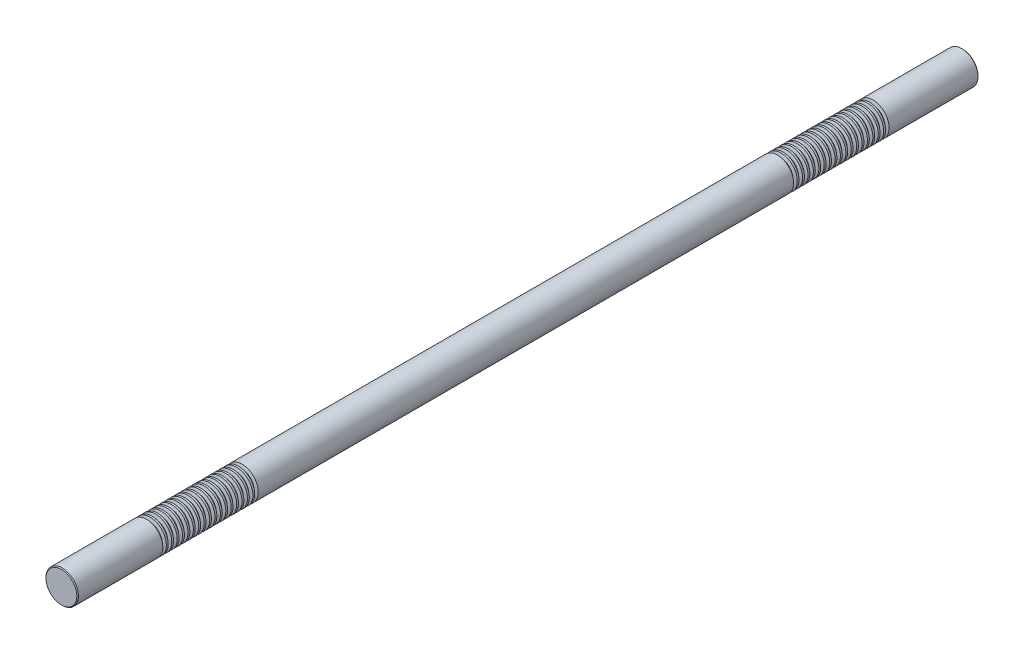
ISO-10303-21;
HEADER;
FILE_DESCRIPTION(('STEP AP214'),'2;1');
FILE_NAME('part.step','',(''),(''),'','','');
FILE_SCHEMA(('AUTOMOTIVE_DESIGN { 1 0 10303 214 1 1 1 1 }'));
ENDSEC;
DATA;
#1=APPLICATION_CONTEXT('core data for automotive mechanical design processes');
#2=APPLICATION_PROTOCOL_DEFINITION('international standard','automotive_design',2000,#1);
#3=PRODUCT_CONTEXT('',#1,'mechanical');
#4=PRODUCT('Part','Part','',(#3));
#5=PRODUCT_RELATED_PRODUCT_CATEGORY('part','',(#4));
#6=PRODUCT_DEFINITION_FORMATION('','',#4);
#7=PRODUCT_DEFINITION_CONTEXT('part definition',#1,'design');
#8=PRODUCT_DEFINITION('design','',#6,#7);
#9=PRODUCT_DEFINITION_SHAPE('','',#8);
#10=(LENGTH_UNIT() NAMED_UNIT(*) SI_UNIT(.MILLI.,.METRE.));
#11=(NAMED_UNIT(*) PLANE_ANGLE_UNIT() SI_UNIT($,.RADIAN.));
#12=(NAMED_UNIT(*) SI_UNIT($,.STERADIAN.) SOLID_ANGLE_UNIT());
#13=UNCERTAINTY_MEASURE_WITH_UNIT(LENGTH_MEASURE(1.E-05),#10,'distance_accuracy_value','');
#14=(GEOMETRIC_REPRESENTATION_CONTEXT(3) GLOBAL_UNCERTAINTY_ASSIGNED_CONTEXT((#13)) GLOBAL_UNIT_ASSIGNED_CONTEXT((#10,
#11,#12)) REPRESENTATION_CONTEXT('',''));
#15=CARTESIAN_POINT('',(0.,0.,0.));
#16=DIRECTION('',(0.,0.,1.));
#17=DIRECTION('',(1.,0.,0.));
#18=AXIS2_PLACEMENT_3D('',#15,#16,#17);
#19=CARTESIAN_POINT('',(0.,0.,500.));
#20=DIRECTION('',(0.,0.,-1.));
#21=DIRECTION('',(-1.,0.,0.));
#22=AXIS2_PLACEMENT_3D('',#19,#20,#21);
#23=CYLINDRICAL_SURFACE('',#22,18.);
#24=CARTESIAN_POINT('',(0.,0.,399.468911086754));
#25=DIRECTION('',(0.,0.,1.));
#26=DIRECTION('',(1.,0.,0.));
#27=AXIS2_PLACEMENT_3D('',#24,#25,#26);
#28=CIRCLE('',#27,18.);
#29=CARTESIAN_POINT('',(18.,0.,399.468911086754));
#30=VERTEX_POINT('',#29);
#31=EDGE_CURVE('E609',#30,#30,#28,.T.);
#32=ORIENTED_EDGE('',*,*,#31,.T.);
#33=EDGE_LOOP('',(#32));
#34=FACE_BOUND('',#33,.T.);
#35=CARTESIAN_POINT('',(0.,0.,401.531088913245));
#36=DIRECTION('',(0.,0.,1.));
#37=DIRECTION('',(1.,0.,0.));
#38=AXIS2_PLACEMENT_3D('',#35,#36,#37);
#39=CIRCLE('',#38,18.);
#40=CARTESIAN_POINT('',(18.,0.,401.531088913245));
#41=VERTEX_POINT('',#40);
#42=EDGE_CURVE('E621',#41,#41,#39,.T.);
#43=ORIENTED_EDGE('',*,*,#42,.F.);
#44=EDGE_LOOP('',(#43));
#45=FACE_BOUND('',#44,.T.);
#46=ADVANCED_FACE('F37',(#34,#45),#23,.T.);
#47=CARTESIAN_POINT('',(0.,0.,393.468911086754));
#48=DIRECTION('',(0.,0.,1.));
#49=DIRECTION('',(1.,0.,0.));
#50=AXIS2_PLACEMENT_3D('',#47,#48,#49);
#51=CIRCLE('',#50,18.);
#52=CARTESIAN_POINT('',(18.,0.,393.468911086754));
#53=VERTEX_POINT('',#52);
#54=EDGE_CURVE('E593',#53,#53,#51,.T.);
#55=ORIENTED_EDGE('',*,*,#54,.T.);
#56=EDGE_LOOP('',(#55));
#57=FACE_BOUND('',#56,.T.);
#58=CARTESIAN_POINT('',(0.,0.,395.531088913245));
#59=DIRECTION('',(0.,0.,1.));
#60=DIRECTION('',(1.,0.,0.));
#61=AXIS2_PLACEMENT_3D('',#58,#59,#60);
#62=CIRCLE('',#61,18.);
#63=CARTESIAN_POINT('',(18.,0.,395.531088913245));
#64=VERTEX_POINT('',#63);
#65=EDGE_CURVE('E605',#64,#64,#62,.T.);
#66=ORIENTED_EDGE('',*,*,#65,.F.);
#67=EDGE_LOOP('',(#66));
#68=FACE_BOUND('',#67,.T.);
#69=ADVANCED_FACE('F657',(#57,#68),#23,.T.);
#70=CARTESIAN_POINT('',(0.,0.,387.468911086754));
#71=DIRECTION('',(0.,0.,1.));
#72=DIRECTION('',(1.,0.,0.));
#73=AXIS2_PLACEMENT_3D('',#70,#71,#72);
#74=CIRCLE('',#73,18.);
#75=CARTESIAN_POINT('',(18.,0.,387.468911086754));
#76=VERTEX_POINT('',#75);
#77=EDGE_CURVE('E577',#76,#76,#74,.T.);
#78=ORIENTED_EDGE('',*,*,#77,.T.);
#79=EDGE_LOOP('',(#78));
#80=FACE_BOUND('',#79,.T.);
#81=CARTESIAN_POINT('',(0.,0.,389.531088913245));
#82=DIRECTION('',(0.,0.,1.));
#83=DIRECTION('',(1.,0.,0.));
#84=AXIS2_PLACEMENT_3D('',#81,#82,#83);
#85=CIRCLE('',#84,18.);
#86=CARTESIAN_POINT('',(18.,0.,389.531088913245));
#87=VERTEX_POINT('',#86);
#88=EDGE_CURVE('E589',#87,#87,#85,.T.);
#89=ORIENTED_EDGE('',*,*,#88,.F.);
#90=EDGE_LOOP('',(#89));
#91=FACE_BOUND('',#90,.T.);
#92=ADVANCED_FACE('F665',(#80,#91),#23,.T.);
#93=CARTESIAN_POINT('',(0.,0.,381.468911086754));
#94=DIRECTION('',(0.,0.,1.));
#95=DIRECTION('',(1.,0.,0.));
#96=AXIS2_PLACEMENT_3D('',#93,#94,#95);
#97=CIRCLE('',#96,18.);
#98=CARTESIAN_POINT('',(18.,0.,381.468911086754));
#99=VERTEX_POINT('',#98);
#100=EDGE_CURVE('E561',#99,#99,#97,.T.);
#101=ORIENTED_EDGE('',*,*,#100,.T.);
#102=EDGE_LOOP('',(#101));
#103=FACE_BOUND('',#102,.T.);
#104=CARTESIAN_POINT('',(0.,0.,383.531088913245));
#105=DIRECTION('',(0.,0.,1.));
#106=DIRECTION('',(1.,0.,0.));
#107=AXIS2_PLACEMENT_3D('',#104,#105,#106);
#108=CIRCLE('',#107,18.);
#109=CARTESIAN_POINT('',(18.,0.,383.531088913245));
#110=VERTEX_POINT('',#109);
#111=EDGE_CURVE('E573',#110,#110,#108,.T.);
#112=ORIENTED_EDGE('',*,*,#111,.F.);
#113=EDGE_LOOP('',(#112));
#114=FACE_BOUND('',#113,.T.);
#115=ADVANCED_FACE('F1394',(#103,#114),#23,.T.);
#116=CARTESIAN_POINT('',(0.,0.,375.468911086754));
#117=DIRECTION('',(0.,0.,1.));
#118=DIRECTION('',(1.,0.,0.));
#119=AXIS2_PLACEMENT_3D('',#116,#117,#118);
#120=CIRCLE('',#119,18.);
#121=CARTESIAN_POINT('',(18.,0.,375.468911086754));
#122=VERTEX_POINT('',#121);
#123=EDGE_CURVE('E545',#122,#122,#120,.T.);
#124=ORIENTED_EDGE('',*,*,#123,.T.);
#125=EDGE_LOOP('',(#124));
#126=FACE_BOUND('',#125,.T.);
#127=CARTESIAN_POINT('',(0.,0.,377.531088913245));
#128=DIRECTION('',(0.,0.,1.));
#129=DIRECTION('',(1.,0.,0.));
#130=AXIS2_PLACEMENT_3D('',#127,#128,#129);
#131=CIRCLE('',#130,18.);
#132=CARTESIAN_POINT('',(18.,0.,377.531088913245));
#133=VERTEX_POINT('',#132);
#134=EDGE_CURVE('E557',#133,#133,#131,.T.);
#135=ORIENTED_EDGE('',*,*,#134,.F.);
#136=EDGE_LOOP('',(#135));
#137=FACE_BOUND('',#136,.T.);
#138=ADVANCED_FACE('F1371',(#126,#137),#23,.T.);
#139=CARTESIAN_POINT('',(0.,0.,369.468911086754));
#140=DIRECTION('',(0.,0.,1.));
#141=DIRECTION('',(1.,0.,0.));
#142=AXIS2_PLACEMENT_3D('',#139,#140,#141);
#143=CIRCLE('',#142,18.);
#144=CARTESIAN_POINT('',(18.,0.,369.468911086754));
#145=VERTEX_POINT('',#144);
#146=EDGE_CURVE('E529',#145,#145,#143,.T.);
#147=ORIENTED_EDGE('',*,*,#146,.T.);
#148=EDGE_LOOP('',(#147));
#149=FACE_BOUND('',#148,.T.);
#150=CARTESIAN_POINT('',(0.,0.,371.531088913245));
#151=DIRECTION('',(0.,0.,1.));
#152=DIRECTION('',(1.,0.,0.));
#153=AXIS2_PLACEMENT_3D('',#150,#151,#152);
#154=CIRCLE('',#153,18.);
#155=CARTESIAN_POINT('',(18.,0.,371.531088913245));
#156=VERTEX_POINT('',#155);
#157=EDGE_CURVE('E541',#156,#156,#154,.T.);
#158=ORIENTED_EDGE('',*,*,#157,.F.);
#159=EDGE_LOOP('',(#158));
#160=FACE_BOUND('',#159,.T.);
#161=ADVANCED_FACE('F1348',(#149,#160),#23,.T.);
#162=CARTESIAN_POINT('',(0.,0.,363.468911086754));
#163=DIRECTION('',(0.,0.,1.));
#164=DIRECTION('',(1.,0.,0.));
#165=AXIS2_PLACEMENT_3D('',#162,#163,#164);
#166=CIRCLE('',#165,18.);
#167=CARTESIAN_POINT('',(18.,0.,363.468911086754));
#168=VERTEX_POINT('',#167);
#169=EDGE_CURVE('E513',#168,#168,#166,.T.);
#170=ORIENTED_EDGE('',*,*,#169,.T.);
#171=EDGE_LOOP('',(#170));
#172=FACE_BOUND('',#171,.T.);
#173=CARTESIAN_POINT('',(0.,0.,365.531088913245));
#174=DIRECTION('',(0.,0.,1.));
#175=DIRECTION('',(1.,0.,0.));
#176=AXIS2_PLACEMENT_3D('',#173,#174,#175);
#177=CIRCLE('',#176,18.);
#178=CARTESIAN_POINT('',(18.,0.,365.531088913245));
#179=VERTEX_POINT('',#178);
#180=EDGE_CURVE('E525',#179,#179,#177,.T.);
#181=ORIENTED_EDGE('',*,*,#180,.F.);
#182=EDGE_LOOP('',(#181));
#183=FACE_BOUND('',#182,.T.);
#184=ADVANCED_FACE('F1325',(#172,#183),#23,.T.);
#185=CARTESIAN_POINT('',(0.,0.,357.468911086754));
#186=DIRECTION('',(0.,0.,1.));
#187=DIRECTION('',(1.,0.,0.));
#188=AXIS2_PLACEMENT_3D('',#185,#186,#187);
#189=CIRCLE('',#188,18.);
#190=CARTESIAN_POINT('',(18.,0.,357.468911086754));
#191=VERTEX_POINT('',#190);
#192=EDGE_CURVE('E497',#191,#191,#189,.T.);
#193=ORIENTED_EDGE('',*,*,#192,.T.);
#194=EDGE_LOOP('',(#193));
#195=FACE_BOUND('',#194,.T.);
#196=CARTESIAN_POINT('',(0.,0.,359.531088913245));
#197=DIRECTION('',(0.,0.,1.));
#198=DIRECTION('',(1.,0.,0.));
#199=AXIS2_PLACEMENT_3D('',#196,#197,#198);
#200=CIRCLE('',#199,18.);
#201=CARTESIAN_POINT('',(18.,0.,359.531088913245));
#202=VERTEX_POINT('',#201);
#203=EDGE_CURVE('E509',#202,#202,#200,.T.);
#204=ORIENTED_EDGE('',*,*,#203,.F.);
#205=EDGE_LOOP('',(#204));
#206=FACE_BOUND('',#205,.T.);
#207=ADVANCED_FACE('F1302',(#195,#206),#23,.T.);
#208=CARTESIAN_POINT('',(0.,0.,351.468911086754));
#209=DIRECTION('',(0.,0.,1.));
#210=DIRECTION('',(1.,0.,0.));
#211=AXIS2_PLACEMENT_3D('',#208,#209,#210);
#212=CIRCLE('',#211,18.);
#213=CARTESIAN_POINT('',(18.,0.,351.468911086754));
#214=VERTEX_POINT('',#213);
#215=EDGE_CURVE('E481',#214,#214,#212,.T.);
#216=ORIENTED_EDGE('',*,*,#215,.T.);
#217=EDGE_LOOP('',(#216));
#218=FACE_BOUND('',#217,.T.);
#219=CARTESIAN_POINT('',(0.,0.,353.531088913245));
#220=DIRECTION('',(0.,0.,1.));
#221=DIRECTION('',(1.,0.,0.));
#222=AXIS2_PLACEMENT_3D('',#219,#220,#221);
#223=CIRCLE('',#222,18.);
#224=CARTESIAN_POINT('',(18.,0.,353.531088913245));
#225=VERTEX_POINT('',#224);
#226=EDGE_CURVE('E493',#225,#225,#223,.T.);
#227=ORIENTED_EDGE('',*,*,#226,.F.);
#228=EDGE_LOOP('',(#227));
#229=FACE_BOUND('',#228,.T.);
#230=ADVANCED_FACE('F1279',(#218,#229),#23,.T.);
#231=CARTESIAN_POINT('',(0.,0.,345.468911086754));
#232=DIRECTION('',(0.,0.,1.));
#233=DIRECTION('',(1.,0.,0.));
#234=AXIS2_PLACEMENT_3D('',#231,#232,#233);
#235=CIRCLE('',#234,18.);
#236=CARTESIAN_POINT('',(18.,0.,345.468911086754));
#237=VERTEX_POINT('',#236);
#238=EDGE_CURVE('E465',#237,#237,#235,.T.);
#239=ORIENTED_EDGE('',*,*,#238,.T.);
#240=EDGE_LOOP('',(#239));
#241=FACE_BOUND('',#240,.T.);
#242=CARTESIAN_POINT('',(0.,0.,347.531088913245));
#243=DIRECTION('',(0.,0.,1.));
#244=DIRECTION('',(1.,0.,0.));
#245=AXIS2_PLACEMENT_3D('',#242,#243,#244);
#246=CIRCLE('',#245,18.);
#247=CARTESIAN_POINT('',(18.,0.,347.531088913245));
#248=VERTEX_POINT('',#247);
#249=EDGE_CURVE('E477',#248,#248,#246,.T.);
#250=ORIENTED_EDGE('',*,*,#249,.F.);
#251=EDGE_LOOP('',(#250));
#252=FACE_BOUND('',#251,.T.);
#253=ADVANCED_FACE('F1256',(#241,#252),#23,.T.);
#254=CARTESIAN_POINT('',(0.,0.,339.468911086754));
#255=DIRECTION('',(0.,0.,1.));
#256=DIRECTION('',(1.,0.,0.));
#257=AXIS2_PLACEMENT_3D('',#254,#255,#256);
#258=CIRCLE('',#257,18.);
#259=CARTESIAN_POINT('',(18.,0.,339.468911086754));
#260=VERTEX_POINT('',#259);
#261=EDGE_CURVE('E449',#260,#260,#258,.T.);
#262=ORIENTED_EDGE('',*,*,#261,.T.);
#263=EDGE_LOOP('',(#262));
#264=FACE_BOUND('',#263,.T.);
#265=CARTESIAN_POINT('',(0.,0.,341.531088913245));
#266=DIRECTION('',(0.,0.,1.));
#267=DIRECTION('',(1.,0.,0.));
#268=AXIS2_PLACEMENT_3D('',#265,#266,#267);
#269=CIRCLE('',#268,18.);
#270=CARTESIAN_POINT('',(18.,0.,341.531088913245));
#271=VERTEX_POINT('',#270);
#272=EDGE_CURVE('E461',#271,#271,#269,.T.);
#273=ORIENTED_EDGE('',*,*,#272,.F.);
#274=EDGE_LOOP('',(#273));
#275=FACE_BOUND('',#274,.T.);
#276=ADVANCED_FACE('F1233',(#264,#275),#23,.T.);
#277=CARTESIAN_POINT('',(0.,0.,333.468911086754));
#278=DIRECTION('',(0.,0.,1.));
#279=DIRECTION('',(1.,0.,0.));
#280=AXIS2_PLACEMENT_3D('',#277,#278,#279);
#281=CIRCLE('',#280,18.);
#282=CARTESIAN_POINT('',(18.,0.,333.468911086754));
#283=VERTEX_POINT('',#282);
#284=EDGE_CURVE('E433',#283,#283,#281,.T.);
#285=ORIENTED_EDGE('',*,*,#284,.T.);
#286=EDGE_LOOP('',(#285));
#287=FACE_BOUND('',#286,.T.);
#288=CARTESIAN_POINT('',(0.,0.,335.531088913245));
#289=DIRECTION('',(0.,0.,1.));
#290=DIRECTION('',(1.,0.,0.));
#291=AXIS2_PLACEMENT_3D('',#288,#289,#290);
#292=CIRCLE('',#291,18.);
#293=CARTESIAN_POINT('',(18.,0.,335.531088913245));
#294=VERTEX_POINT('',#293);
#295=EDGE_CURVE('E445',#294,#294,#292,.T.);
#296=ORIENTED_EDGE('',*,*,#295,.F.);
#297=EDGE_LOOP('',(#296));
#298=FACE_BOUND('',#297,.T.);
#299=ADVANCED_FACE('F1210',(#287,#298),#23,.T.);
#300=CARTESIAN_POINT('',(0.,0.,327.468911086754));
#301=DIRECTION('',(0.,0.,1.));
#302=DIRECTION('',(1.,0.,0.));
#303=AXIS2_PLACEMENT_3D('',#300,#301,#302);
#304=CIRCLE('',#303,18.);
#305=CARTESIAN_POINT('',(18.,0.,327.468911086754));
#306=VERTEX_POINT('',#305);
#307=EDGE_CURVE('E418',#306,#306,#304,.T.);
#308=ORIENTED_EDGE('',*,*,#307,.T.);
#309=EDGE_LOOP('',(#308));
#310=FACE_BOUND('',#309,.T.);
#311=CARTESIAN_POINT('',(0.,0.,329.531088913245));
#312=DIRECTION('',(0.,0.,1.));
#313=DIRECTION('',(1.,0.,0.));
#314=AXIS2_PLACEMENT_3D('',#311,#312,#313);
#315=CIRCLE('',#314,18.);
#316=CARTESIAN_POINT('',(18.,0.,329.531088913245));
#317=VERTEX_POINT('',#316);
#318=EDGE_CURVE('E429',#317,#317,#315,.T.);
#319=ORIENTED_EDGE('',*,*,#318,.F.);
#320=EDGE_LOOP('',(#319));
#321=FACE_BOUND('',#320,.T.);
#322=ADVANCED_FACE('F1187',(#310,#321),#23,.T.);
#323=CARTESIAN_POINT('',(0.,0.,321.468911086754));
#324=DIRECTION('',(0.,0.,1.));
#325=DIRECTION('',(1.,0.,0.));
#326=AXIS2_PLACEMENT_3D('',#323,#324,#325);
#327=CIRCLE('',#326,18.);
#328=CARTESIAN_POINT('',(18.,0.,321.468911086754));
#329=VERTEX_POINT('',#328);
#330=EDGE_CURVE('E402',#329,#329,#327,.T.);
#331=ORIENTED_EDGE('',*,*,#330,.T.);
#332=EDGE_LOOP('',(#331));
#333=FACE_BOUND('',#332,.T.);
#334=CARTESIAN_POINT('',(0.,0.,323.531088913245));
#335=DIRECTION('',(0.,0.,1.));
#336=DIRECTION('',(1.,0.,0.));
#337=AXIS2_PLACEMENT_3D('',#334,#335,#336);
#338=CIRCLE('',#337,18.);
#339=CARTESIAN_POINT('',(18.,0.,323.531088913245));
#340=VERTEX_POINT('',#339);
#341=EDGE_CURVE('E414',#340,#340,#338,.T.);
#342=ORIENTED_EDGE('',*,*,#341,.F.);
#343=EDGE_LOOP('',(#342));
#344=FACE_BOUND('',#343,.T.);
#345=ADVANCED_FACE('F1164',(#333,#344),#23,.T.);
#346=CARTESIAN_POINT('',(0.,0.,315.468911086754));
#347=DIRECTION('',(0.,0.,1.));
#348=DIRECTION('',(1.,0.,0.));
#349=AXIS2_PLACEMENT_3D('',#346,#347,#348);
#350=CIRCLE('',#349,18.);
#351=CARTESIAN_POINT('',(18.,0.,315.468911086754));
#352=VERTEX_POINT('',#351);
#353=EDGE_CURVE('E386',#352,#352,#350,.T.);
#354=ORIENTED_EDGE('',*,*,#353,.T.);
#355=EDGE_LOOP('',(#354));
#356=FACE_BOUND('',#355,.T.);
#357=CARTESIAN_POINT('',(0.,0.,317.531088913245));
#358=DIRECTION('',(0.,0.,1.));
#359=DIRECTION('',(1.,0.,0.));
#360=AXIS2_PLACEMENT_3D('',#357,#358,#359);
#361=CIRCLE('',#360,18.);
#362=CARTESIAN_POINT('',(18.,0.,317.531088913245));
#363=VERTEX_POINT('',#362);
#364=EDGE_CURVE('E398',#363,#363,#361,.T.);
#365=ORIENTED_EDGE('',*,*,#364,.F.);
#366=EDGE_LOOP('',(#365));
#367=FACE_BOUND('',#366,.T.);
#368=ADVANCED_FACE('F1141',(#356,#367),#23,.T.);
#369=CARTESIAN_POINT('',(0.,0.,309.468911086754));
#370=DIRECTION('',(0.,0.,1.));
#371=DIRECTION('',(1.,0.,0.));
#372=AXIS2_PLACEMENT_3D('',#369,#370,#371);
#373=CIRCLE('',#372,18.);
#374=CARTESIAN_POINT('',(18.,0.,309.468911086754));
#375=VERTEX_POINT('',#374);
#376=EDGE_CURVE('E370',#375,#375,#373,.T.);
#377=ORIENTED_EDGE('',*,*,#376,.T.);
#378=EDGE_LOOP('',(#377));
#379=FACE_BOUND('',#378,.T.);
#380=CARTESIAN_POINT('',(0.,0.,311.531088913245));
#381=DIRECTION('',(0.,0.,1.));
#382=DIRECTION('',(1.,0.,0.));
#383=AXIS2_PLACEMENT_3D('',#380,#381,#382);
#384=CIRCLE('',#383,18.);
#385=CARTESIAN_POINT('',(18.,0.,311.531088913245));
#386=VERTEX_POINT('',#385);
#387=EDGE_CURVE('E382',#386,#386,#384,.T.);
#388=ORIENTED_EDGE('',*,*,#387,.F.);
#389=EDGE_LOOP('',(#388));
#390=FACE_BOUND('',#389,.T.);
#391=ADVANCED_FACE('F1118',(#379,#390),#23,.T.);
#392=CARTESIAN_POINT('',(0.,0.,303.468911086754));
#393=DIRECTION('',(0.,0.,1.));
#394=DIRECTION('',(1.,0.,0.));
#395=AXIS2_PLACEMENT_3D('',#392,#393,#394);
#396=CIRCLE('',#395,18.);
#397=CARTESIAN_POINT('',(18.,0.,303.468911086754));
#398=VERTEX_POINT('',#397);
#399=EDGE_CURVE('E354',#398,#398,#396,.T.);
#400=ORIENTED_EDGE('',*,*,#399,.T.);
#401=EDGE_LOOP('',(#400));
#402=FACE_BOUND('',#401,.T.);
#403=CARTESIAN_POINT('',(0.,0.,305.531088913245));
#404=DIRECTION('',(0.,0.,1.));
#405=DIRECTION('',(1.,0.,0.));
#406=AXIS2_PLACEMENT_3D('',#403,#404,#405);
#407=CIRCLE('',#406,18.);
#408=CARTESIAN_POINT('',(18.,0.,305.531088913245));
#409=VERTEX_POINT('',#408);
#410=EDGE_CURVE('E366',#409,#409,#407,.T.);
#411=ORIENTED_EDGE('',*,*,#410,.F.);
#412=EDGE_LOOP('',(#411));
#413=FACE_BOUND('',#412,.T.);
#414=ADVANCED_FACE('F1095',(#402,#413),#23,.T.);
#415=CARTESIAN_POINT('',(0.,0.,-294.531088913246));
#416=DIRECTION('',(0.,0.,1.));
#417=DIRECTION('',(1.,0.,0.));
#418=AXIS2_PLACEMENT_3D('',#415,#416,#417);
#419=CIRCLE('',#418,18.);
#420=CARTESIAN_POINT('',(18.,0.,-294.531088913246));
#421=VERTEX_POINT('',#420);
#422=EDGE_CURVE('E338',#421,#421,#419,.T.);
#423=ORIENTED_EDGE('',*,*,#422,.T.);
#424=EDGE_LOOP('',(#423));
#425=FACE_BOUND('',#424,.T.);
#426=CARTESIAN_POINT('',(0.,0.,299.531088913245));
#427=DIRECTION('',(0.,0.,1.));
#428=DIRECTION('',(1.,0.,0.));
#429=AXIS2_PLACEMENT_3D('',#426,#427,#428);
#430=CIRCLE('',#429,18.);
#431=CARTESIAN_POINT('',(18.,0.,299.531088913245));
#432=VERTEX_POINT('',#431);
#433=EDGE_CURVE('E350',#432,#432,#430,.T.);
#434=ORIENTED_EDGE('',*,*,#433,.F.);
#435=EDGE_LOOP('',(#434));
#436=FACE_BOUND('',#435,.T.);
#437=ADVANCED_FACE('F1072',(#425,#436),#23,.T.);
#438=CARTESIAN_POINT('',(0.,0.,-300.531088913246));
#439=DIRECTION('',(0.,0.,1.));
#440=DIRECTION('',(1.,0.,0.));
#441=AXIS2_PLACEMENT_3D('',#438,#439,#440);
#442=CIRCLE('',#441,18.);
#443=CARTESIAN_POINT('',(18.,0.,-300.531088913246));
#444=VERTEX_POINT('',#443);
#445=EDGE_CURVE('E323',#444,#444,#442,.T.);
#446=ORIENTED_EDGE('',*,*,#445,.T.);
#447=EDGE_LOOP('',(#446));
#448=FACE_BOUND('',#447,.T.);
#449=CARTESIAN_POINT('',(0.,0.,-298.468911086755));
#450=DIRECTION('',(0.,0.,1.));
#451=DIRECTION('',(1.,0.,0.));
#452=AXIS2_PLACEMENT_3D('',#449,#450,#451);
#453=CIRCLE('',#452,18.);
#454=CARTESIAN_POINT('',(18.,0.,-298.468911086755));
#455=VERTEX_POINT('',#454);
#456=EDGE_CURVE('E334',#455,#455,#453,.T.);
#457=ORIENTED_EDGE('',*,*,#456,.F.);
#458=EDGE_LOOP('',(#457));
#459=FACE_BOUND('',#458,.T.);
#460=ADVANCED_FACE('F1049',(#448,#459),#23,.T.);
#461=CARTESIAN_POINT('',(0.,0.,-306.531088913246));
#462=DIRECTION('',(0.,0.,1.));
#463=DIRECTION('',(1.,0.,0.));
#464=AXIS2_PLACEMENT_3D('',#461,#462,#463);
#465=CIRCLE('',#464,18.);
#466=CARTESIAN_POINT('',(18.,0.,-306.531088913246));
#467=VERTEX_POINT('',#466);
#468=EDGE_CURVE('E307',#467,#467,#465,.T.);
#469=ORIENTED_EDGE('',*,*,#468,.T.);
#470=EDGE_LOOP('',(#469));
#471=FACE_BOUND('',#470,.T.);
#472=CARTESIAN_POINT('',(0.,0.,-304.468911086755));
#473=DIRECTION('',(0.,0.,1.));
#474=DIRECTION('',(1.,0.,0.));
#475=AXIS2_PLACEMENT_3D('',#472,#473,#474);
#476=CIRCLE('',#475,18.);
#477=CARTESIAN_POINT('',(18.,0.,-304.468911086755));
#478=VERTEX_POINT('',#477);
#479=EDGE_CURVE('E319',#478,#478,#476,.T.);
#480=ORIENTED_EDGE('',*,*,#479,.F.);
#481=EDGE_LOOP('',(#480));
#482=FACE_BOUND('',#481,.T.);
#483=ADVANCED_FACE('F1026',(#471,#482),#23,.T.);
#484=CARTESIAN_POINT('',(0.,0.,-312.531088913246));
#485=DIRECTION('',(0.,0.,1.));
#486=DIRECTION('',(1.,0.,0.));
#487=AXIS2_PLACEMENT_3D('',#484,#485,#486);
#488=CIRCLE('',#487,18.);
#489=CARTESIAN_POINT('',(18.,0.,-312.531088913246));
#490=VERTEX_POINT('',#489);
#491=EDGE_CURVE('E291',#490,#490,#488,.T.);
#492=ORIENTED_EDGE('',*,*,#491,.T.);
#493=EDGE_LOOP('',(#492));
#494=FACE_BOUND('',#493,.T.);
#495=CARTESIAN_POINT('',(0.,0.,-310.468911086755));
#496=DIRECTION('',(0.,0.,1.));
#497=DIRECTION('',(1.,0.,0.));
#498=AXIS2_PLACEMENT_3D('',#495,#496,#497);
#499=CIRCLE('',#498,18.);
#500=CARTESIAN_POINT('',(18.,0.,-310.468911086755));
#501=VERTEX_POINT('',#500);
#502=EDGE_CURVE('E303',#501,#501,#499,.T.);
#503=ORIENTED_EDGE('',*,*,#502,.F.);
#504=EDGE_LOOP('',(#503));
#505=FACE_BOUND('',#504,.T.);
#506=ADVANCED_FACE('F1003',(#494,#505),#23,.T.);
#507=CARTESIAN_POINT('',(0.,0.,-318.531088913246));
#508=DIRECTION('',(0.,0.,1.));
#509=DIRECTION('',(1.,0.,0.));
#510=AXIS2_PLACEMENT_3D('',#507,#508,#509);
#511=CIRCLE('',#510,18.);
#512=CARTESIAN_POINT('',(18.,0.,-318.531088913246));
#513=VERTEX_POINT('',#512);
#514=EDGE_CURVE('E276',#513,#513,#511,.T.);
#515=ORIENTED_EDGE('',*,*,#514,.T.);
#516=EDGE_LOOP('',(#515));
#517=FACE_BOUND('',#516,.T.);
#518=CARTESIAN_POINT('',(0.,0.,-316.468911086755));
#519=DIRECTION('',(0.,0.,1.));
#520=DIRECTION('',(1.,0.,0.));
#521=AXIS2_PLACEMENT_3D('',#518,#519,#520);
#522=CIRCLE('',#521,18.);
#523=CARTESIAN_POINT('',(18.,0.,-316.468911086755));
#524=VERTEX_POINT('',#523);
#525=EDGE_CURVE('E287',#524,#524,#522,.T.);
#526=ORIENTED_EDGE('',*,*,#525,.F.);
#527=EDGE_LOOP('',(#526));
#528=FACE_BOUND('',#527,.T.);
#529=ADVANCED_FACE('F980',(#517,#528),#23,.T.);
#530=CARTESIAN_POINT('',(0.,0.,-324.531088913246));
#531=DIRECTION('',(0.,0.,1.));
#532=DIRECTION('',(1.,0.,0.));
#533=AXIS2_PLACEMENT_3D('',#530,#531,#532);
#534=CIRCLE('',#533,18.);
#535=CARTESIAN_POINT('',(18.,0.,-324.531088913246));
#536=VERTEX_POINT('',#535);
#537=EDGE_CURVE('E260',#536,#536,#534,.T.);
#538=ORIENTED_EDGE('',*,*,#537,.T.);
#539=EDGE_LOOP('',(#538));
#540=FACE_BOUND('',#539,.T.);
#541=CARTESIAN_POINT('',(0.,0.,-322.468911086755));
#542=DIRECTION('',(0.,0.,1.));
#543=DIRECTION('',(1.,0.,0.));
#544=AXIS2_PLACEMENT_3D('',#541,#542,#543);
#545=CIRCLE('',#544,18.);
#546=CARTESIAN_POINT('',(18.,0.,-322.468911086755));
#547=VERTEX_POINT('',#546);
#548=EDGE_CURVE('E272',#547,#547,#545,.T.);
#549=ORIENTED_EDGE('',*,*,#548,.F.);
#550=EDGE_LOOP('',(#549));
#551=FACE_BOUND('',#550,.T.);
#552=ADVANCED_FACE('F957',(#540,#551),#23,.T.);
#553=CARTESIAN_POINT('',(0.,0.,-330.531088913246));
#554=DIRECTION('',(0.,0.,1.));
#555=DIRECTION('',(1.,0.,0.));
#556=AXIS2_PLACEMENT_3D('',#553,#554,#555);
#557=CIRCLE('',#556,18.);
#558=CARTESIAN_POINT('',(18.,0.,-330.531088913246));
#559=VERTEX_POINT('',#558);
#560=EDGE_CURVE('E244',#559,#559,#557,.T.);
#561=ORIENTED_EDGE('',*,*,#560,.T.);
#562=EDGE_LOOP('',(#561));
#563=FACE_BOUND('',#562,.T.);
#564=CARTESIAN_POINT('',(0.,0.,-328.468911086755));
#565=DIRECTION('',(0.,0.,1.));
#566=DIRECTION('',(1.,0.,0.));
#567=AXIS2_PLACEMENT_3D('',#564,#565,#566);
#568=CIRCLE('',#567,18.);
#569=CARTESIAN_POINT('',(18.,0.,-328.468911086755));
#570=VERTEX_POINT('',#569);
#571=EDGE_CURVE('E256',#570,#570,#568,.T.);
#572=ORIENTED_EDGE('',*,*,#571,.F.);
#573=EDGE_LOOP('',(#572));
#574=FACE_BOUND('',#573,.T.);
#575=ADVANCED_FACE('F934',(#563,#574),#23,.T.);
#576=CARTESIAN_POINT('',(0.,0.,-336.531088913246));
#577=DIRECTION('',(0.,0.,1.));
#578=DIRECTION('',(1.,0.,0.));
#579=AXIS2_PLACEMENT_3D('',#576,#577,#578);
#580=CIRCLE('',#579,18.);
#581=CARTESIAN_POINT('',(18.,0.,-336.531088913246));
#582=VERTEX_POINT('',#581);
#583=EDGE_CURVE('E228',#582,#582,#580,.T.);
#584=ORIENTED_EDGE('',*,*,#583,.T.);
#585=EDGE_LOOP('',(#584));
#586=FACE_BOUND('',#585,.T.);
#587=CARTESIAN_POINT('',(0.,0.,-334.468911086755));
#588=DIRECTION('',(0.,0.,1.));
#589=DIRECTION('',(1.,0.,0.));
#590=AXIS2_PLACEMENT_3D('',#587,#588,#589);
#591=CIRCLE('',#590,18.);
#592=CARTESIAN_POINT('',(18.,0.,-334.468911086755));
#593=VERTEX_POINT('',#592);
#594=EDGE_CURVE('E240',#593,#593,#591,.T.);
#595=ORIENTED_EDGE('',*,*,#594,.F.);
#596=EDGE_LOOP('',(#595));
#597=FACE_BOUND('',#596,.T.);
#598=ADVANCED_FACE('F911',(#586,#597),#23,.T.);
#599=CARTESIAN_POINT('',(0.,0.,-342.531088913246));
#600=DIRECTION('',(0.,0.,1.));
#601=DIRECTION('',(1.,0.,0.));
#602=AXIS2_PLACEMENT_3D('',#599,#600,#601);
#603=CIRCLE('',#602,18.);
#604=CARTESIAN_POINT('',(18.,0.,-342.531088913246));
#605=VERTEX_POINT('',#604);
#606=EDGE_CURVE('E212',#605,#605,#603,.T.);
#607=ORIENTED_EDGE('',*,*,#606,.T.);
#608=EDGE_LOOP('',(#607));
#609=FACE_BOUND('',#608,.T.);
#610=CARTESIAN_POINT('',(0.,0.,-340.468911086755));
#611=DIRECTION('',(0.,0.,1.));
#612=DIRECTION('',(1.,0.,0.));
#613=AXIS2_PLACEMENT_3D('',#610,#611,#612);
#614=CIRCLE('',#613,18.);
#615=CARTESIAN_POINT('',(18.,0.,-340.468911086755));
#616=VERTEX_POINT('',#615);
#617=EDGE_CURVE('E224',#616,#616,#614,.T.);
#618=ORIENTED_EDGE('',*,*,#617,.F.);
#619=EDGE_LOOP('',(#618));
#620=FACE_BOUND('',#619,.T.);
#621=ADVANCED_FACE('F888',(#609,#620),#23,.T.);
#622=CARTESIAN_POINT('',(0.,0.,-348.531088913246));
#623=DIRECTION('',(0.,0.,1.));
#624=DIRECTION('',(1.,0.,0.));
#625=AXIS2_PLACEMENT_3D('',#622,#623,#624);
#626=CIRCLE('',#625,18.);
#627=CARTESIAN_POINT('',(18.,0.,-348.531088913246));
#628=VERTEX_POINT('',#627);
#629=EDGE_CURVE('E196',#628,#628,#626,.T.);
#630=ORIENTED_EDGE('',*,*,#629,.T.);
#631=EDGE_LOOP('',(#630));
#632=FACE_BOUND('',#631,.T.);
#633=CARTESIAN_POINT('',(0.,0.,-346.468911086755));
#634=DIRECTION('',(0.,0.,1.));
#635=DIRECTION('',(1.,0.,0.));
#636=AXIS2_PLACEMENT_3D('',#633,#634,#635);
#637=CIRCLE('',#636,18.);
#638=CARTESIAN_POINT('',(18.,0.,-346.468911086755));
#639=VERTEX_POINT('',#638);
#640=EDGE_CURVE('E208',#639,#639,#637,.T.);
#641=ORIENTED_EDGE('',*,*,#640,.F.);
#642=EDGE_LOOP('',(#641));
#643=FACE_BOUND('',#642,.T.);
#644=ADVANCED_FACE('F865',(#632,#643),#23,.T.);
#645=CARTESIAN_POINT('',(0.,0.,-354.531088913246));
#646=DIRECTION('',(0.,0.,1.));
#647=DIRECTION('',(1.,0.,0.));
#648=AXIS2_PLACEMENT_3D('',#645,#646,#647);
#649=CIRCLE('',#648,18.);
#650=CARTESIAN_POINT('',(18.,0.,-354.531088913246));
#651=VERTEX_POINT('',#650);
#652=EDGE_CURVE('E180',#651,#651,#649,.T.);
#653=ORIENTED_EDGE('',*,*,#652,.T.);
#654=EDGE_LOOP('',(#653));
#655=FACE_BOUND('',#654,.T.);
#656=CARTESIAN_POINT('',(0.,0.,-352.468911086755));
#657=DIRECTION('',(0.,0.,1.));
#658=DIRECTION('',(1.,0.,0.));
#659=AXIS2_PLACEMENT_3D('',#656,#657,#658);
#660=CIRCLE('',#659,18.);
#661=CARTESIAN_POINT('',(18.,0.,-352.468911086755));
#662=VERTEX_POINT('',#661);
#663=EDGE_CURVE('E192',#662,#662,#660,.T.);
#664=ORIENTED_EDGE('',*,*,#663,.F.);
#665=EDGE_LOOP('',(#664));
#666=FACE_BOUND('',#665,.T.);
#667=ADVANCED_FACE('F842',(#655,#666),#23,.T.);
#668=CARTESIAN_POINT('',(0.,0.,-360.531088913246));
#669=DIRECTION('',(0.,0.,1.));
#670=DIRECTION('',(1.,0.,0.));
#671=AXIS2_PLACEMENT_3D('',#668,#669,#670);
#672=CIRCLE('',#671,18.);
#673=CARTESIAN_POINT('',(18.,0.,-360.531088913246));
#674=VERTEX_POINT('',#673);
#675=EDGE_CURVE('E165',#674,#674,#672,.T.);
#676=ORIENTED_EDGE('',*,*,#675,.T.);
#677=EDGE_LOOP('',(#676));
#678=FACE_BOUND('',#677,.T.);
#679=CARTESIAN_POINT('',(0.,0.,-358.468911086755));
#680=DIRECTION('',(0.,0.,1.));
#681=DIRECTION('',(1.,0.,0.));
#682=AXIS2_PLACEMENT_3D('',#679,#680,#681);
#683=CIRCLE('',#682,18.);
#684=CARTESIAN_POINT('',(18.,0.,-358.468911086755));
#685=VERTEX_POINT('',#684);
#686=EDGE_CURVE('E177',#685,#685,#683,.T.);
#687=ORIENTED_EDGE('',*,*,#686,.F.);
#688=EDGE_LOOP('',(#687));
#689=FACE_BOUND('',#688,.T.);
#690=ADVANCED_FACE('F819',(#678,#689),#23,.T.);
#691=CARTESIAN_POINT('',(0.,0.,-366.531088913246));
#692=DIRECTION('',(0.,0.,1.));
#693=DIRECTION('',(1.,0.,0.));
#694=AXIS2_PLACEMENT_3D('',#691,#692,#693);
#695=CIRCLE('',#694,18.);
#696=CARTESIAN_POINT('',(18.,0.,-366.531088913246));
#697=VERTEX_POINT('',#696);
#698=EDGE_CURVE('E149',#697,#697,#695,.T.);
#699=ORIENTED_EDGE('',*,*,#698,.T.);
#700=EDGE_LOOP('',(#699));
#701=FACE_BOUND('',#700,.T.);
#702=CARTESIAN_POINT('',(0.,0.,-364.468911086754));
#703=DIRECTION('',(0.,0.,1.));
#704=DIRECTION('',(1.,0.,0.));
#705=AXIS2_PLACEMENT_3D('',#702,#703,#704);
#706=CIRCLE('',#705,18.);
#707=CARTESIAN_POINT('',(18.,0.,-364.468911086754));
#708=VERTEX_POINT('',#707);
#709=EDGE_CURVE('E161',#708,#708,#706,.T.);
#710=ORIENTED_EDGE('',*,*,#709,.F.);
#711=EDGE_LOOP('',(#710));
#712=FACE_BOUND('',#711,.T.);
#713=ADVANCED_FACE('F796',(#701,#712),#23,.T.);
#714=CARTESIAN_POINT('',(0.,0.,-372.531088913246));
#715=DIRECTION('',(0.,0.,1.));
#716=DIRECTION('',(1.,0.,0.));
#717=AXIS2_PLACEMENT_3D('',#714,#715,#716);
#718=CIRCLE('',#717,18.);
#719=CARTESIAN_POINT('',(18.,0.,-372.531088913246));
#720=VERTEX_POINT('',#719);
#721=EDGE_CURVE('E133',#720,#720,#718,.T.);
#722=ORIENTED_EDGE('',*,*,#721,.T.);
#723=EDGE_LOOP('',(#722));
#724=FACE_BOUND('',#723,.T.);
#725=CARTESIAN_POINT('',(0.,0.,-370.468911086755));
#726=DIRECTION('',(0.,0.,1.));
#727=DIRECTION('',(1.,0.,0.));
#728=AXIS2_PLACEMENT_3D('',#725,#726,#727);
#729=CIRCLE('',#728,18.);
#730=CARTESIAN_POINT('',(18.,0.,-370.468911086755));
#731=VERTEX_POINT('',#730);
#732=EDGE_CURVE('E145',#731,#731,#729,.T.);
#733=ORIENTED_EDGE('',*,*,#732,.F.);
#734=EDGE_LOOP('',(#733));
#735=FACE_BOUND('',#734,.T.);
#736=ADVANCED_FACE('F773',(#724,#735),#23,.T.);
#737=CARTESIAN_POINT('',(0.,0.,-378.531088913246));
#738=DIRECTION('',(0.,0.,1.));
#739=DIRECTION('',(1.,0.,0.));
#740=AXIS2_PLACEMENT_3D('',#737,#738,#739);
#741=CIRCLE('',#740,18.);
#742=CARTESIAN_POINT('',(18.,0.,-378.531088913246));
#743=VERTEX_POINT('',#742);
#744=EDGE_CURVE('E117',#743,#743,#741,.T.);
#745=ORIENTED_EDGE('',*,*,#744,.T.);
#746=EDGE_LOOP('',(#745));
#747=FACE_BOUND('',#746,.T.);
#748=CARTESIAN_POINT('',(0.,0.,-376.468911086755));
#749=DIRECTION('',(0.,0.,1.));
#750=DIRECTION('',(1.,0.,0.));
#751=AXIS2_PLACEMENT_3D('',#748,#749,#750);
#752=CIRCLE('',#751,18.);
#753=CARTESIAN_POINT('',(18.,0.,-376.468911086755));
#754=VERTEX_POINT('',#753);
#755=EDGE_CURVE('E129',#754,#754,#752,.T.);
#756=ORIENTED_EDGE('',*,*,#755,.F.);
#757=EDGE_LOOP('',(#756));
#758=FACE_BOUND('',#757,.T.);
#759=ADVANCED_FACE('F750',(#747,#758),#23,.T.);
#760=CARTESIAN_POINT('',(0.,0.,-384.531088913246));
#761=DIRECTION('',(0.,0.,1.));
#762=DIRECTION('',(1.,0.,0.));
#763=AXIS2_PLACEMENT_3D('',#760,#761,#762);
#764=CIRCLE('',#763,18.);
#765=CARTESIAN_POINT('',(18.,0.,-384.531088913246));
#766=VERTEX_POINT('',#765);
#767=EDGE_CURVE('E101',#766,#766,#764,.T.);
#768=ORIENTED_EDGE('',*,*,#767,.T.);
#769=EDGE_LOOP('',(#768));
#770=FACE_BOUND('',#769,.T.);
#771=CARTESIAN_POINT('',(0.,0.,-382.468911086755));
#772=DIRECTION('',(0.,0.,1.));
#773=DIRECTION('',(1.,0.,0.));
#774=AXIS2_PLACEMENT_3D('',#771,#772,#773);
#775=CIRCLE('',#774,18.);
#776=CARTESIAN_POINT('',(18.,0.,-382.468911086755));
#777=VERTEX_POINT('',#776);
#778=EDGE_CURVE('E113',#777,#777,#775,.T.);
#779=ORIENTED_EDGE('',*,*,#778,.F.);
#780=EDGE_LOOP('',(#779));
#781=FACE_BOUND('',#780,.T.);
#782=ADVANCED_FACE('F727',(#770,#781),#23,.T.);
#783=CARTESIAN_POINT('',(0.,0.,-390.531088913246));
#784=DIRECTION('',(0.,0.,1.));
#785=DIRECTION('',(1.,0.,0.));
#786=AXIS2_PLACEMENT_3D('',#783,#784,#785);
#787=CIRCLE('',#786,18.);
#788=CARTESIAN_POINT('',(18.,0.,-390.531088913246));
#789=VERTEX_POINT('',#788);
#790=EDGE_CURVE('E85',#789,#789,#787,.T.);
#791=ORIENTED_EDGE('',*,*,#790,.T.);
#792=EDGE_LOOP('',(#791));
#793=FACE_BOUND('',#792,.T.);
#794=CARTESIAN_POINT('',(0.,0.,-388.468911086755));
#795=DIRECTION('',(0.,0.,1.));
#796=DIRECTION('',(1.,0.,0.));
#797=AXIS2_PLACEMENT_3D('',#794,#795,#796);
#798=CIRCLE('',#797,18.);
#799=CARTESIAN_POINT('',(18.,0.,-388.468911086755));
#800=VERTEX_POINT('',#799);
#801=EDGE_CURVE('E97',#800,#800,#798,.T.);
#802=ORIENTED_EDGE('',*,*,#801,.F.);
#803=EDGE_LOOP('',(#802));
#804=FACE_BOUND('',#803,.T.);
#805=ADVANCED_FACE('F680',(#793,#804),#23,.T.);
#806=CARTESIAN_POINT('',(0.,0.,-396.531088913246));
#807=DIRECTION('',(0.,0.,1.));
#808=DIRECTION('',(1.,0.,0.));
#809=AXIS2_PLACEMENT_3D('',#806,#807,#808);
#810=CIRCLE('',#809,18.);
#811=CARTESIAN_POINT('',(18.,0.,-396.531088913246));
#812=VERTEX_POINT('',#811);
#813=EDGE_CURVE('E69',#812,#812,#810,.T.);
#814=ORIENTED_EDGE('',*,*,#813,.T.);
#815=EDGE_LOOP('',(#814));
#816=FACE_BOUND('',#815,.T.);
#817=CARTESIAN_POINT('',(0.,0.,-394.468911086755));
#818=DIRECTION('',(0.,0.,1.));
#819=DIRECTION('',(1.,0.,0.));
#820=AXIS2_PLACEMENT_3D('',#817,#818,#819);
#821=CIRCLE('',#820,18.);
#822=CARTESIAN_POINT('',(18.,0.,-394.468911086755));
#823=VERTEX_POINT('',#822);
#824=EDGE_CURVE('E81',#823,#823,#821,.T.);
#825=ORIENTED_EDGE('',*,*,#824,.F.);
#826=EDGE_LOOP('',(#825));
#827=FACE_BOUND('',#826,.T.);
#828=ADVANCED_FACE('F673',(#816,#827),#23,.T.);
#829=CARTESIAN_POINT('',(0.,0.,-499.1));
#830=DIRECTION('',(0.,0.,1.));
#831=DIRECTION('',(1.,0.,0.));
#832=AXIS2_PLACEMENT_3D('',#829,#830,#831);
#833=CIRCLE('',#832,18.);
#834=CARTESIAN_POINT('',(18.,0.,-499.1));
#835=VERTEX_POINT('',#834);
#836=EDGE_CURVE('E52',#835,#835,#833,.T.);
#837=ORIENTED_EDGE('',*,*,#836,.T.);
#838=EDGE_LOOP('',(#837));
#839=FACE_BOUND('',#838,.T.);
#840=CARTESIAN_POINT('',(0.,0.,-400.468911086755));
#841=DIRECTION('',(0.,0.,1.));
#842=DIRECTION('',(1.,0.,0.));
#843=AXIS2_PLACEMENT_3D('',#840,#841,#842);
#844=CIRCLE('',#843,18.);
#845=CARTESIAN_POINT('',(18.,0.,-400.468911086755));
#846=VERTEX_POINT('',#845);
#847=EDGE_CURVE('E65',#846,#846,#844,.T.);
#848=ORIENTED_EDGE('',*,*,#847,.F.);
#849=EDGE_LOOP('',(#848));
#850=FACE_BOUND('',#849,.T.);
#851=ADVANCED_FACE('F661',(#839,#850),#23,.T.);
#852=CARTESIAN_POINT('',(0.,0.,-500.));
#853=DIRECTION('',(0.,0.,1.));
#854=DIRECTION('',(1.,0.,0.));
#855=AXIS2_PLACEMENT_3D('',#852,#853,#854);
#856=PLANE('',#855);
#857=CARTESIAN_POINT('',(0.,0.,-500.));
#858=DIRECTION('',(0.,0.,1.));
#859=DIRECTION('',(1.,0.,0.));
#860=AXIS2_PLACEMENT_3D('',#857,#858,#859);
#861=CIRCLE('',#860,17.1);
#862=CARTESIAN_POINT('',(17.0999999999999,0.,-500.));
#863=VERTEX_POINT('',#862);
#864=EDGE_CURVE('E45',#863,#863,#861,.F.);
#865=ORIENTED_EDGE('',*,*,#864,.T.);
#866=EDGE_LOOP('',(#865));
#867=FACE_BOUND('',#866,.T.);
#868=ADVANCED_FACE('F672',(#867),#856,.F.);
#869=CARTESIAN_POINT('',(0.,0.,-499.1));
#870=DIRECTION('',(0.,0.,1.));
#871=DIRECTION('',(1.,0.,0.));
#872=AXIS2_PLACEMENT_3D('',#869,#870,#871);
#873=CONICAL_SURFACE('',#872,18.,0.7853981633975);
#874=CARTESIAN_POINT('',(17.0999999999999,0.,-500.));
#875=CARTESIAN_POINT('',(17.1093749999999,0.,-499.990625));
#876=CARTESIAN_POINT('',(17.1187499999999,0.,-499.98125));
#877=CARTESIAN_POINT('',(17.1374999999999,0.,-499.9625));
#878=CARTESIAN_POINT('',(17.1468749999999,0.,-499.953125));
#879=CARTESIAN_POINT('',(17.165625,0.,-499.934375));
#880=CARTESIAN_POINT('',(17.175,0.,-499.925));
#881=CARTESIAN_POINT('',(17.19375,0.,-499.90625));
#882=CARTESIAN_POINT('',(17.2031249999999,0.,-499.896875));
#883=CARTESIAN_POINT('',(17.2218749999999,0.,-499.878125));
#884=CARTESIAN_POINT('',(17.2312499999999,0.,-499.86875));
#885=CARTESIAN_POINT('',(17.25,0.,-499.85));
#886=CARTESIAN_POINT('',(17.259375,0.,-499.840625));
#887=CARTESIAN_POINT('',(17.2781249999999,0.,-499.821875));
#888=CARTESIAN_POINT('',(17.2875,0.,-499.8125));
#889=CARTESIAN_POINT('',(17.30625,0.,-499.79375));
#890=CARTESIAN_POINT('',(17.315625,0.,-499.784375));
#891=CARTESIAN_POINT('',(17.334375,0.,-499.765625));
#892=CARTESIAN_POINT('',(17.34375,0.,-499.75625));
#893=CARTESIAN_POINT('',(17.3625,0.,-499.7375));
#894=CARTESIAN_POINT('',(17.371875,0.,-499.728125));
#895=CARTESIAN_POINT('',(17.390625,0.,-499.709375));
#896=CARTESIAN_POINT('',(17.4,0.,-499.7));
#897=CARTESIAN_POINT('',(17.41875,0.,-499.68125));
#898=CARTESIAN_POINT('',(17.428125,0.,-499.671875));
#899=CARTESIAN_POINT('',(17.446875,0.,-499.653125));
#900=CARTESIAN_POINT('',(17.45625,0.,-499.64375));
#901=CARTESIAN_POINT('',(17.475,0.,-499.625));
#902=CARTESIAN_POINT('',(17.484375,0.,-499.615625));
#903=CARTESIAN_POINT('',(17.503125,0.,-499.596875));
#904=CARTESIAN_POINT('',(17.5125,0.,-499.5875));
#905=CARTESIAN_POINT('',(17.53125,0.,-499.56875));
#906=CARTESIAN_POINT('',(17.540625,0.,-499.559375));
#907=CARTESIAN_POINT('',(17.559375,0.,-499.540625));
#908=CARTESIAN_POINT('',(17.56875,0.,-499.53125));
#909=CARTESIAN_POINT('',(17.5875,0.,-499.5125));
#910=CARTESIAN_POINT('',(17.596875,0.,-499.503125));
#911=CARTESIAN_POINT('',(17.615625,0.,-499.484375));
#912=CARTESIAN_POINT('',(17.625,0.,-499.475));
#913=CARTESIAN_POINT('',(17.64375,0.,-499.45625));
#914=CARTESIAN_POINT('',(17.653125,0.,-499.446875));
#915=CARTESIAN_POINT('',(17.671875,0.,-499.428125));
#916=CARTESIAN_POINT('',(17.68125,0.,-499.41875));
#917=CARTESIAN_POINT('',(17.7,0.,-499.4));
#918=CARTESIAN_POINT('',(17.709375,0.,-499.390625));
#919=CARTESIAN_POINT('',(17.728125,0.,-499.371875));
#920=CARTESIAN_POINT('',(17.7375,0.,-499.3625));
#921=CARTESIAN_POINT('',(17.75625,0.,-499.34375));
#922=CARTESIAN_POINT('',(17.765625,0.,-499.334375));
#923=CARTESIAN_POINT('',(17.784375,0.,-499.315625));
#924=CARTESIAN_POINT('',(17.79375,0.,-499.30625));
#925=CARTESIAN_POINT('',(17.8125,0.,-499.2875));
#926=CARTESIAN_POINT('',(17.821875,0.,-499.278125));
#927=CARTESIAN_POINT('',(17.840625,0.,-499.259375));
#928=CARTESIAN_POINT('',(17.85,0.,-499.25));
#929=CARTESIAN_POINT('',(17.86875,0.,-499.23125));
#930=CARTESIAN_POINT('',(17.878125,0.,-499.221875));
#931=CARTESIAN_POINT('',(17.896875,0.,-499.203125));
#932=CARTESIAN_POINT('',(17.90625,0.,-499.19375));
#933=CARTESIAN_POINT('',(17.925,0.,-499.175));
#934=CARTESIAN_POINT('',(17.934375,0.,-499.165625));
#935=CARTESIAN_POINT('',(17.953125,0.,-499.146875));
#936=CARTESIAN_POINT('',(17.9625,0.,-499.1375));
#937=CARTESIAN_POINT('',(17.98125,0.,-499.11875));
#938=CARTESIAN_POINT('',(17.990625,0.,-499.109375));
#939=CARTESIAN_POINT('',(18.,0.,-499.1));
#940=B_SPLINE_CURVE_WITH_KNOTS('',3,(#874,#875,#876,#877,#878,#879,#880,#881,#882,#883,#884,
#885,#886,#887,#888,#889,#890,#891,#892,#893,#894,#895,#896,#897,#898,#899,#900,#901,#902,#903,
#904,#905,#906,#907,#908,#909,#910,#911,#912,#913,#914,#915,#916,#917,#918,#919,#920,#921,#922,
#923,#924,#925,#926,#927,#928,#929,#930,#931,#932,#933,#934,#935,#936,#937,#938,#939),
.UNSPECIFIED.,.F.,.F.,(4,2,2,2,2,2,2,2,2,2,2,2,2,2,2,2,2,2,2,2,2,2,2,2,2,2,2,2,2,2,2,2,4),(0.,
0.0397747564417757,0.0795495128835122,0.119324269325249,0.159099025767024,0.198873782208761,
0.238648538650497,0.278423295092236,0.318198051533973,0.357972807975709,0.397747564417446,
0.437522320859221,0.477297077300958,0.517071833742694,0.556846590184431,0.596621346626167,
0.636396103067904,0.676170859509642,0.715945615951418,0.755720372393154,0.795495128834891,
0.835269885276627,0.875044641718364,0.9148193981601,0.954594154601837,0.994368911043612,
1.03414366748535,1.07391842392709,1.11369318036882,1.15346793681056,1.1932426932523,
1.23301744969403,1.27279220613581),.UNSPECIFIED.);
#941=EDGE_CURVE('BSEAM679',#863,#835,#940,.T.);
#942=ORIENTED_EDGE('',*,*,#864,.F.);
#943=ORIENTED_EDGE('',*,*,#836,.F.);
#944=ORIENTED_EDGE('',*,*,#941,.T.);
#945=ORIENTED_EDGE('',*,*,#941,.F.);
#946=EDGE_LOOP('',(#942,#944,#943,#945));
#947=FACE_BOUND('',#946,.T.);
#948=ADVANCED_FACE('F679',(#947),#873,.T.);
#949=CARTESIAN_POINT('',(0.,0.,-399.531088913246));
#950=DIRECTION('',(0.,0.,-1.));
#951=DIRECTION('',(-1.,0.,0.));
#952=AXIS2_PLACEMENT_3D('',#949,#950,#951);
#953=CONICAL_SURFACE('',#952,14.5,1.30899693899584);
#954=ORIENTED_EDGE('',*,*,#847,.T.);
#955=EDGE_LOOP('',(#954));
#956=FACE_BOUND('',#955,.T.);
#957=CARTESIAN_POINT('',(0.,0.,-399.531088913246));
#958=DIRECTION('',(0.,0.,1.));
#959=DIRECTION('',(1.,0.,0.));
#960=AXIS2_PLACEMENT_3D('',#957,#958,#959);
#961=CIRCLE('',#960,14.5);
#962=CARTESIAN_POINT('',(14.5,0.,-399.531088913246));
#963=VERTEX_POINT('',#962);
#964=EDGE_CURVE('E77',#963,#963,#961,.T.);
#965=ORIENTED_EDGE('',*,*,#964,.F.);
#966=EDGE_LOOP('',(#965));
#967=FACE_BOUND('',#966,.T.);
#968=ADVANCED_FACE('F686',(#956,#967),#953,.T.);
#969=CARTESIAN_POINT('',(0.,0.,-396.531088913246));
#970=DIRECTION('',(0.,0.,1.));
#971=DIRECTION('',(1.,0.,0.));
#972=AXIS2_PLACEMENT_3D('',#969,#970,#971);
#973=CONICAL_SURFACE('',#972,18.,1.30899693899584);
#974=CARTESIAN_POINT('',(0.,0.,-397.468911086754));
#975=DIRECTION('',(0.,0.,1.));
#976=DIRECTION('',(1.,0.,0.));
#977=AXIS2_PLACEMENT_3D('',#974,#975,#976);
#978=CIRCLE('',#977,14.5);
#979=CARTESIAN_POINT('',(14.5,0.,-397.468911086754));
#980=VERTEX_POINT('',#979);
#981=EDGE_CURVE('E73',#980,#980,#978,.T.);
#982=ORIENTED_EDGE('',*,*,#981,.T.);
#983=EDGE_LOOP('',(#982));
#984=FACE_BOUND('',#983,.T.);
#985=ORIENTED_EDGE('',*,*,#813,.F.);
#986=EDGE_LOOP('',(#985));
#987=FACE_BOUND('',#986,.T.);
#988=ADVANCED_FACE('F689',(#984,#987),#973,.T.);
#989=CARTESIAN_POINT('',(0.,0.,499.1));
#990=DIRECTION('',(0.,0.,1.));
#991=DIRECTION('',(1.,0.,0.));
#992=AXIS2_PLACEMENT_3D('',#989,#990,#991);
#993=CYLINDRICAL_SURFACE('',#992,14.5);
#994=ORIENTED_EDGE('',*,*,#964,.T.);
#995=EDGE_LOOP('',(#994));
#996=FACE_BOUND('',#995,.T.);
#997=ORIENTED_EDGE('',*,*,#981,.F.);
#998=EDGE_LOOP('',(#997));
#999=FACE_BOUND('',#998,.T.);
#1000=ADVANCED_FACE('F693',(#996,#999),#993,.T.);
#1001=CARTESIAN_POINT('',(0.,0.,-393.531088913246));
#1002=DIRECTION('',(0.,0.,-1.));
#1003=DIRECTION('',(-1.,0.,0.));
#1004=AXIS2_PLACEMENT_3D('',#1001,#1002,#1003);
#1005=CONICAL_SURFACE('',#1004,14.5,1.30899693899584);
#1006=ORIENTED_EDGE('',*,*,#824,.T.);
#1007=EDGE_LOOP('',(#1006));
#1008=FACE_BOUND('',#1007,.T.);
#1009=CARTESIAN_POINT('',(0.,0.,-393.531088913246));
#1010=DIRECTION('',(0.,0.,1.));
#1011=DIRECTION('',(1.,0.,0.));
#1012=AXIS2_PLACEMENT_3D('',#1009,#1010,#1011);
#1013=CIRCLE('',#1012,14.5);
#1014=CARTESIAN_POINT('',(14.5,0.,-393.531088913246));
#1015=VERTEX_POINT('',#1014);
#1016=EDGE_CURVE('E93',#1015,#1015,#1013,.T.);
#1017=ORIENTED_EDGE('',*,*,#1016,.F.);
#1018=EDGE_LOOP('',(#1017));
#1019=FACE_BOUND('',#1018,.T.);
#1020=ADVANCED_FACE('F696',(#1008,#1019),#1005,.T.);
#1021=CARTESIAN_POINT('',(0.,0.,-390.531088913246));
#1022=DIRECTION('',(0.,0.,1.));
#1023=DIRECTION('',(1.,0.,0.));
#1024=AXIS2_PLACEMENT_3D('',#1021,#1022,#1023);
#1025=CONICAL_SURFACE('',#1024,18.,1.30899693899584);
#1026=CARTESIAN_POINT('',(0.,0.,-391.468911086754));
#1027=DIRECTION('',(0.,0.,1.));
#1028=DIRECTION('',(1.,0.,0.));
#1029=AXIS2_PLACEMENT_3D('',#1026,#1027,#1028);
#1030=CIRCLE('',#1029,14.5);
#1031=CARTESIAN_POINT('',(14.5,0.,-391.468911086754));
#1032=VERTEX_POINT('',#1031);
#1033=EDGE_CURVE('E89',#1032,#1032,#1030,.T.);
#1034=ORIENTED_EDGE('',*,*,#1033,.T.);
#1035=EDGE_LOOP('',(#1034));
#1036=FACE_BOUND('',#1035,.T.);
#1037=ORIENTED_EDGE('',*,*,#790,.F.);
#1038=EDGE_LOOP('',(#1037));
#1039=FACE_BOUND('',#1038,.T.);
#1040=ADVANCED_FACE('F709',(#1036,#1039),#1025,.T.);
#1041=CARTESIAN_POINT('',(0.,0.,-394.468911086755));
#1042=DIRECTION('',(0.,0.,1.));
#1043=DIRECTION('',(1.,0.,0.));
#1044=AXIS2_PLACEMENT_3D('',#1041,#1042,#1043);
#1045=CYLINDRICAL_SURFACE('',#1044,14.5);
#1046=ORIENTED_EDGE('',*,*,#1016,.T.);
#1047=EDGE_LOOP('',(#1046));
#1048=FACE_BOUND('',#1047,.T.);
#1049=ORIENTED_EDGE('',*,*,#1033,.F.);
#1050=EDGE_LOOP('',(#1049));
#1051=FACE_BOUND('',#1050,.T.);
#1052=ADVANCED_FACE('F713',(#1048,#1051),#1045,.T.);
#1053=CARTESIAN_POINT('',(0.,0.,-387.531088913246));
#1054=DIRECTION('',(0.,0.,-1.));
#1055=DIRECTION('',(-1.,0.,0.));
#1056=AXIS2_PLACEMENT_3D('',#1053,#1054,#1055);
#1057=CONICAL_SURFACE('',#1056,14.5,1.30899693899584);
#1058=ORIENTED_EDGE('',*,*,#801,.T.);
#1059=EDGE_LOOP('',(#1058));
#1060=FACE_BOUND('',#1059,.T.);
#1061=CARTESIAN_POINT('',(0.,0.,-387.531088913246));
#1062=DIRECTION('',(0.,0.,1.));
#1063=DIRECTION('',(1.,0.,0.));
#1064=AXIS2_PLACEMENT_3D('',#1061,#1062,#1063);
#1065=CIRCLE('',#1064,14.5);
#1066=CARTESIAN_POINT('',(14.5,0.,-387.531088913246));
#1067=VERTEX_POINT('',#1066);
#1068=EDGE_CURVE('E109',#1067,#1067,#1065,.T.);
#1069=ORIENTED_EDGE('',*,*,#1068,.F.);
#1070=EDGE_LOOP('',(#1069));
#1071=FACE_BOUND('',#1070,.T.);
#1072=ADVANCED_FACE('F716',(#1060,#1071),#1057,.T.);
#1073=CARTESIAN_POINT('',(0.,0.,-384.531088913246));
#1074=DIRECTION('',(0.,0.,1.));
#1075=DIRECTION('',(1.,0.,0.));
#1076=AXIS2_PLACEMENT_3D('',#1073,#1074,#1075);
#1077=CONICAL_SURFACE('',#1076,18.,1.30899693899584);
#1078=CARTESIAN_POINT('',(0.,0.,-385.468911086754));
#1079=DIRECTION('',(0.,0.,1.));
#1080=DIRECTION('',(1.,0.,0.));
#1081=AXIS2_PLACEMENT_3D('',#1078,#1079,#1080);
#1082=CIRCLE('',#1081,14.5);
#1083=CARTESIAN_POINT('',(14.5,0.,-385.468911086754));
#1084=VERTEX_POINT('',#1083);
#1085=EDGE_CURVE('E105',#1084,#1084,#1082,.T.);
#1086=ORIENTED_EDGE('',*,*,#1085,.T.);
#1087=EDGE_LOOP('',(#1086));
#1088=FACE_BOUND('',#1087,.T.);
#1089=ORIENTED_EDGE('',*,*,#767,.F.);
#1090=EDGE_LOOP('',(#1089));
#1091=FACE_BOUND('',#1090,.T.);
#1092=ADVANCED_FACE('F732',(#1088,#1091),#1077,.T.);
#1093=CARTESIAN_POINT('',(0.,0.,-388.468911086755));
#1094=DIRECTION('',(0.,0.,1.));
#1095=DIRECTION('',(1.,0.,0.));
#1096=AXIS2_PLACEMENT_3D('',#1093,#1094,#1095);
#1097=CYLINDRICAL_SURFACE('',#1096,14.5);
#1098=ORIENTED_EDGE('',*,*,#1068,.T.);
#1099=EDGE_LOOP('',(#1098));
#1100=FACE_BOUND('',#1099,.T.);
#1101=ORIENTED_EDGE('',*,*,#1085,.F.);
#1102=EDGE_LOOP('',(#1101));
#1103=FACE_BOUND('',#1102,.T.);
#1104=ADVANCED_FACE('F736',(#1100,#1103),#1097,.T.);
#1105=CARTESIAN_POINT('',(0.,0.,-381.531088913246));
#1106=DIRECTION('',(0.,0.,-1.));
#1107=DIRECTION('',(-1.,0.,0.));
#1108=AXIS2_PLACEMENT_3D('',#1105,#1106,#1107);
#1109=CONICAL_SURFACE('',#1108,14.5,1.30899693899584);
#1110=ORIENTED_EDGE('',*,*,#778,.T.);
#1111=EDGE_LOOP('',(#1110));
#1112=FACE_BOUND('',#1111,.T.);
#1113=CARTESIAN_POINT('',(0.,0.,-381.531088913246));
#1114=DIRECTION('',(0.,0.,1.));
#1115=DIRECTION('',(1.,0.,0.));
#1116=AXIS2_PLACEMENT_3D('',#1113,#1114,#1115);
#1117=CIRCLE('',#1116,14.5);
#1118=CARTESIAN_POINT('',(14.5,0.,-381.531088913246));
#1119=VERTEX_POINT('',#1118);
#1120=EDGE_CURVE('E125',#1119,#1119,#1117,.T.);
#1121=ORIENTED_EDGE('',*,*,#1120,.F.);
#1122=EDGE_LOOP('',(#1121));
#1123=FACE_BOUND('',#1122,.T.);
#1124=ADVANCED_FACE('F739',(#1112,#1123),#1109,.T.);
#1125=CARTESIAN_POINT('',(0.,0.,-378.531088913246));
#1126=DIRECTION('',(0.,0.,1.));
#1127=DIRECTION('',(1.,0.,0.));
#1128=AXIS2_PLACEMENT_3D('',#1125,#1126,#1127);
#1129=CONICAL_SURFACE('',#1128,18.,1.30899693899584);
#1130=CARTESIAN_POINT('',(0.,0.,-379.468911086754));
#1131=DIRECTION('',(0.,0.,1.));
#1132=DIRECTION('',(1.,0.,0.));
#1133=AXIS2_PLACEMENT_3D('',#1130,#1131,#1132);
#1134=CIRCLE('',#1133,14.5);
#1135=CARTESIAN_POINT('',(14.5,0.,-379.468911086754));
#1136=VERTEX_POINT('',#1135);
#1137=EDGE_CURVE('E121',#1136,#1136,#1134,.T.);
#1138=ORIENTED_EDGE('',*,*,#1137,.T.);
#1139=EDGE_LOOP('',(#1138));
#1140=FACE_BOUND('',#1139,.T.);
#1141=ORIENTED_EDGE('',*,*,#744,.F.);
#1142=EDGE_LOOP('',(#1141));
#1143=FACE_BOUND('',#1142,.T.);
#1144=ADVANCED_FACE('F755',(#1140,#1143),#1129,.T.);
#1145=CARTESIAN_POINT('',(0.,0.,-382.468911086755));
#1146=DIRECTION('',(0.,0.,1.));
#1147=DIRECTION('',(1.,0.,0.));
#1148=AXIS2_PLACEMENT_3D('',#1145,#1146,#1147);
#1149=CYLINDRICAL_SURFACE('',#1148,14.5);
#1150=ORIENTED_EDGE('',*,*,#1120,.T.);
#1151=EDGE_LOOP('',(#1150));
#1152=FACE_BOUND('',#1151,.T.);
#1153=ORIENTED_EDGE('',*,*,#1137,.F.);
#1154=EDGE_LOOP('',(#1153));
#1155=FACE_BOUND('',#1154,.T.);
#1156=ADVANCED_FACE('F759',(#1152,#1155),#1149,.T.);
#1157=CARTESIAN_POINT('',(0.,0.,-375.531088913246));
#1158=DIRECTION('',(0.,0.,-1.));
#1159=DIRECTION('',(-1.,0.,0.));
#1160=AXIS2_PLACEMENT_3D('',#1157,#1158,#1159);
#1161=CONICAL_SURFACE('',#1160,14.5,1.30899693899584);
#1162=ORIENTED_EDGE('',*,*,#755,.T.);
#1163=EDGE_LOOP('',(#1162));
#1164=FACE_BOUND('',#1163,.T.);
#1165=CARTESIAN_POINT('',(0.,0.,-375.531088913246));
#1166=DIRECTION('',(0.,0.,1.));
#1167=DIRECTION('',(1.,0.,0.));
#1168=AXIS2_PLACEMENT_3D('',#1165,#1166,#1167);
#1169=CIRCLE('',#1168,14.5);
#1170=CARTESIAN_POINT('',(14.5,0.,-375.531088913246));
#1171=VERTEX_POINT('',#1170);
#1172=EDGE_CURVE('E141',#1171,#1171,#1169,.T.);
#1173=ORIENTED_EDGE('',*,*,#1172,.F.);
#1174=EDGE_LOOP('',(#1173));
#1175=FACE_BOUND('',#1174,.T.);
#1176=ADVANCED_FACE('F762',(#1164,#1175),#1161,.T.);
#1177=CARTESIAN_POINT('',(0.,0.,-372.531088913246));
#1178=DIRECTION('',(0.,0.,1.));
#1179=DIRECTION('',(1.,0.,0.));
#1180=AXIS2_PLACEMENT_3D('',#1177,#1178,#1179);
#1181=CONICAL_SURFACE('',#1180,18.,1.30899693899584);
#1182=CARTESIAN_POINT('',(0.,0.,-373.468911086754));
#1183=DIRECTION('',(0.,0.,1.));
#1184=DIRECTION('',(1.,0.,0.));
#1185=AXIS2_PLACEMENT_3D('',#1182,#1183,#1184);
#1186=CIRCLE('',#1185,14.5);
#1187=CARTESIAN_POINT('',(14.5,0.,-373.468911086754));
#1188=VERTEX_POINT('',#1187);
#1189=EDGE_CURVE('E137',#1188,#1188,#1186,.T.);
#1190=ORIENTED_EDGE('',*,*,#1189,.T.);
#1191=EDGE_LOOP('',(#1190));
#1192=FACE_BOUND('',#1191,.T.);
#1193=ORIENTED_EDGE('',*,*,#721,.F.);
#1194=EDGE_LOOP('',(#1193));
#1195=FACE_BOUND('',#1194,.T.);
#1196=ADVANCED_FACE('F778',(#1192,#1195),#1181,.T.);
#1197=CARTESIAN_POINT('',(0.,0.,-376.468911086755));
#1198=DIRECTION('',(0.,0.,1.));
#1199=DIRECTION('',(1.,0.,0.));
#1200=AXIS2_PLACEMENT_3D('',#1197,#1198,#1199);
#1201=CYLINDRICAL_SURFACE('',#1200,14.5);
#1202=ORIENTED_EDGE('',*,*,#1172,.T.);
#1203=EDGE_LOOP('',(#1202));
#1204=FACE_BOUND('',#1203,.T.);
#1205=ORIENTED_EDGE('',*,*,#1189,.F.);
#1206=EDGE_LOOP('',(#1205));
#1207=FACE_BOUND('',#1206,.T.);
#1208=ADVANCED_FACE('F782',(#1204,#1207),#1201,.T.);
#1209=CARTESIAN_POINT('',(0.,0.,-369.531088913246));
#1210=DIRECTION('',(0.,0.,-1.));
#1211=DIRECTION('',(-1.,0.,0.));
#1212=AXIS2_PLACEMENT_3D('',#1209,#1210,#1211);
#1213=CONICAL_SURFACE('',#1212,14.5,1.30899693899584);
#1214=ORIENTED_EDGE('',*,*,#732,.T.);
#1215=EDGE_LOOP('',(#1214));
#1216=FACE_BOUND('',#1215,.T.);
#1217=CARTESIAN_POINT('',(0.,0.,-369.531088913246));
#1218=DIRECTION('',(0.,0.,1.));
#1219=DIRECTION('',(1.,0.,0.));
#1220=AXIS2_PLACEMENT_3D('',#1217,#1218,#1219);
#1221=CIRCLE('',#1220,14.5);
#1222=CARTESIAN_POINT('',(14.5,0.,-369.531088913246));
#1223=VERTEX_POINT('',#1222);
#1224=EDGE_CURVE('E157',#1223,#1223,#1221,.T.);
#1225=ORIENTED_EDGE('',*,*,#1224,.F.);
#1226=EDGE_LOOP('',(#1225));
#1227=FACE_BOUND('',#1226,.T.);
#1228=ADVANCED_FACE('F785',(#1216,#1227),#1213,.T.);
#1229=CARTESIAN_POINT('',(0.,0.,-366.531088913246));
#1230=DIRECTION('',(0.,0.,1.));
#1231=DIRECTION('',(1.,0.,0.));
#1232=AXIS2_PLACEMENT_3D('',#1229,#1230,#1231);
#1233=CONICAL_SURFACE('',#1232,18.,1.30899693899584);
#1234=CARTESIAN_POINT('',(0.,0.,-367.468911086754));
#1235=DIRECTION('',(0.,0.,1.));
#1236=DIRECTION('',(1.,0.,0.));
#1237=AXIS2_PLACEMENT_3D('',#1234,#1235,#1236);
#1238=CIRCLE('',#1237,14.5);
#1239=CARTESIAN_POINT('',(14.5,0.,-367.468911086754));
#1240=VERTEX_POINT('',#1239);
#1241=EDGE_CURVE('E153',#1240,#1240,#1238,.T.);
#1242=ORIENTED_EDGE('',*,*,#1241,.T.);
#1243=EDGE_LOOP('',(#1242));
#1244=FACE_BOUND('',#1243,.T.);
#1245=ORIENTED_EDGE('',*,*,#698,.F.);
#1246=EDGE_LOOP('',(#1245));
#1247=FACE_BOUND('',#1246,.T.);
#1248=ADVANCED_FACE('F801',(#1244,#1247),#1233,.T.);
#1249=CARTESIAN_POINT('',(0.,0.,-370.468911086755));
#1250=DIRECTION('',(0.,0.,1.));
#1251=DIRECTION('',(1.,0.,0.));
#1252=AXIS2_PLACEMENT_3D('',#1249,#1250,#1251);
#1253=CYLINDRICAL_SURFACE('',#1252,14.5);
#1254=ORIENTED_EDGE('',*,*,#1224,.T.);
#1255=EDGE_LOOP('',(#1254));
#1256=FACE_BOUND('',#1255,.T.);
#1257=ORIENTED_EDGE('',*,*,#1241,.F.);
#1258=EDGE_LOOP('',(#1257));
#1259=FACE_BOUND('',#1258,.T.);
#1260=ADVANCED_FACE('F805',(#1256,#1259),#1253,.T.);
#1261=CARTESIAN_POINT('',(0.,0.,-363.531088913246));
#1262=DIRECTION('',(0.,0.,-1.));
#1263=DIRECTION('',(-1.,0.,0.));
#1264=AXIS2_PLACEMENT_3D('',#1261,#1262,#1263);
#1265=CONICAL_SURFACE('',#1264,14.5,1.30899693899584);
#1266=ORIENTED_EDGE('',*,*,#709,.T.);
#1267=EDGE_LOOP('',(#1266));
#1268=FACE_BOUND('',#1267,.T.);
#1269=CARTESIAN_POINT('',(0.,0.,-363.531088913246));
#1270=DIRECTION('',(0.,0.,1.));
#1271=DIRECTION('',(1.,0.,0.));
#1272=AXIS2_PLACEMENT_3D('',#1269,#1270,#1271);
#1273=CIRCLE('',#1272,14.5);
#1274=CARTESIAN_POINT('',(14.5,0.,-363.531088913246));
#1275=VERTEX_POINT('',#1274);
#1276=EDGE_CURVE('E173',#1275,#1275,#1273,.T.);
#1277=ORIENTED_EDGE('',*,*,#1276,.F.);
#1278=EDGE_LOOP('',(#1277));
#1279=FACE_BOUND('',#1278,.T.);
#1280=ADVANCED_FACE('F808',(#1268,#1279),#1265,.T.);
#1281=CARTESIAN_POINT('',(0.,0.,-360.531088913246));
#1282=DIRECTION('',(0.,0.,1.));
#1283=DIRECTION('',(1.,0.,0.));
#1284=AXIS2_PLACEMENT_3D('',#1281,#1282,#1283);
#1285=CONICAL_SURFACE('',#1284,18.,1.30899693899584);
#1286=CARTESIAN_POINT('',(0.,0.,-361.468911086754));
#1287=DIRECTION('',(0.,0.,1.));
#1288=DIRECTION('',(1.,0.,0.));
#1289=AXIS2_PLACEMENT_3D('',#1286,#1287,#1288);
#1290=CIRCLE('',#1289,14.5);
#1291=CARTESIAN_POINT('',(14.5,0.,-361.468911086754));
#1292=VERTEX_POINT('',#1291);
#1293=EDGE_CURVE('E169',#1292,#1292,#1290,.T.);
#1294=ORIENTED_EDGE('',*,*,#1293,.T.);
#1295=EDGE_LOOP('',(#1294));
#1296=FACE_BOUND('',#1295,.T.);
#1297=ORIENTED_EDGE('',*,*,#675,.F.);
#1298=EDGE_LOOP('',(#1297));
#1299=FACE_BOUND('',#1298,.T.);
#1300=ADVANCED_FACE('F824',(#1296,#1299),#1285,.T.);
#1301=CARTESIAN_POINT('',(0.,0.,-364.468911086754));
#1302=DIRECTION('',(0.,0.,1.));
#1303=DIRECTION('',(1.,0.,0.));
#1304=AXIS2_PLACEMENT_3D('',#1301,#1302,#1303);
#1305=CYLINDRICAL_SURFACE('',#1304,14.5);
#1306=ORIENTED_EDGE('',*,*,#1276,.T.);
#1307=EDGE_LOOP('',(#1306));
#1308=FACE_BOUND('',#1307,.T.);
#1309=ORIENTED_EDGE('',*,*,#1293,.F.);
#1310=EDGE_LOOP('',(#1309));
#1311=FACE_BOUND('',#1310,.T.);
#1312=ADVANCED_FACE('F828',(#1308,#1311),#1305,.T.);
#1313=CARTESIAN_POINT('',(0.,0.,-357.531088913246));
#1314=DIRECTION('',(0.,0.,-1.));
#1315=DIRECTION('',(-1.,0.,0.));
#1316=AXIS2_PLACEMENT_3D('',#1313,#1314,#1315);
#1317=CONICAL_SURFACE('',#1316,14.5,1.30899693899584);
#1318=ORIENTED_EDGE('',*,*,#686,.T.);
#1319=EDGE_LOOP('',(#1318));
#1320=FACE_BOUND('',#1319,.T.);
#1321=CARTESIAN_POINT('',(0.,0.,-357.531088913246));
#1322=DIRECTION('',(0.,0.,1.));
#1323=DIRECTION('',(1.,0.,0.));
#1324=AXIS2_PLACEMENT_3D('',#1321,#1322,#1323);
#1325=CIRCLE('',#1324,14.5);
#1326=CARTESIAN_POINT('',(14.5,0.,-357.531088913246));
#1327=VERTEX_POINT('',#1326);
#1328=EDGE_CURVE('E188',#1327,#1327,#1325,.T.);
#1329=ORIENTED_EDGE('',*,*,#1328,.F.);
#1330=EDGE_LOOP('',(#1329));
#1331=FACE_BOUND('',#1330,.T.);
#1332=ADVANCED_FACE('F831',(#1320,#1331),#1317,.T.);
#1333=CARTESIAN_POINT('',(0.,0.,-354.531088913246));
#1334=DIRECTION('',(0.,0.,1.));
#1335=DIRECTION('',(1.,0.,0.));
#1336=AXIS2_PLACEMENT_3D('',#1333,#1334,#1335);
#1337=CONICAL_SURFACE('',#1336,18.,1.30899693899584);
#1338=CARTESIAN_POINT('',(0.,0.,-355.468911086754));
#1339=DIRECTION('',(0.,0.,1.));
#1340=DIRECTION('',(1.,0.,0.));
#1341=AXIS2_PLACEMENT_3D('',#1338,#1339,#1340);
#1342=CIRCLE('',#1341,14.5);
#1343=CARTESIAN_POINT('',(14.5,0.,-355.468911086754));
#1344=VERTEX_POINT('',#1343);
#1345=EDGE_CURVE('E184',#1344,#1344,#1342,.T.);
#1346=ORIENTED_EDGE('',*,*,#1345,.T.);
#1347=EDGE_LOOP('',(#1346));
#1348=FACE_BOUND('',#1347,.T.);
#1349=ORIENTED_EDGE('',*,*,#652,.F.);
#1350=EDGE_LOOP('',(#1349));
#1351=FACE_BOUND('',#1350,.T.);
#1352=ADVANCED_FACE('F847',(#1348,#1351),#1337,.T.);
#1353=CARTESIAN_POINT('',(0.,0.,-358.468911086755));
#1354=DIRECTION('',(0.,0.,1.));
#1355=DIRECTION('',(1.,0.,0.));
#1356=AXIS2_PLACEMENT_3D('',#1353,#1354,#1355);
#1357=CYLINDRICAL_SURFACE('',#1356,14.5);
#1358=ORIENTED_EDGE('',*,*,#1328,.T.);
#1359=EDGE_LOOP('',(#1358));
#1360=FACE_BOUND('',#1359,.T.);
#1361=ORIENTED_EDGE('',*,*,#1345,.F.);
#1362=EDGE_LOOP('',(#1361));
#1363=FACE_BOUND('',#1362,.T.);
#1364=ADVANCED_FACE('F851',(#1360,#1363),#1357,.T.);
#1365=CARTESIAN_POINT('',(0.,0.,-351.531088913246));
#1366=DIRECTION('',(0.,0.,-1.));
#1367=DIRECTION('',(-1.,0.,0.));
#1368=AXIS2_PLACEMENT_3D('',#1365,#1366,#1367);
#1369=CONICAL_SURFACE('',#1368,14.5,1.30899693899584);
#1370=ORIENTED_EDGE('',*,*,#663,.T.);
#1371=EDGE_LOOP('',(#1370));
#1372=FACE_BOUND('',#1371,.T.);
#1373=CARTESIAN_POINT('',(0.,0.,-351.531088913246));
#1374=DIRECTION('',(0.,0.,1.));
#1375=DIRECTION('',(1.,0.,0.));
#1376=AXIS2_PLACEMENT_3D('',#1373,#1374,#1375);
#1377=CIRCLE('',#1376,14.5);
#1378=CARTESIAN_POINT('',(14.5,0.,-351.531088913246));
#1379=VERTEX_POINT('',#1378);
#1380=EDGE_CURVE('E204',#1379,#1379,#1377,.T.);
#1381=ORIENTED_EDGE('',*,*,#1380,.F.);
#1382=EDGE_LOOP('',(#1381));
#1383=FACE_BOUND('',#1382,.T.);
#1384=ADVANCED_FACE('F854',(#1372,#1383),#1369,.T.);
#1385=CARTESIAN_POINT('',(0.,0.,-348.531088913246));
#1386=DIRECTION('',(0.,0.,1.));
#1387=DIRECTION('',(1.,0.,0.));
#1388=AXIS2_PLACEMENT_3D('',#1385,#1386,#1387);
#1389=CONICAL_SURFACE('',#1388,18.,1.30899693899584);
#1390=CARTESIAN_POINT('',(0.,0.,-349.468911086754));
#1391=DIRECTION('',(0.,0.,1.));
#1392=DIRECTION('',(1.,0.,0.));
#1393=AXIS2_PLACEMENT_3D('',#1390,#1391,#1392);
#1394=CIRCLE('',#1393,14.5);
#1395=CARTESIAN_POINT('',(14.5,0.,-349.468911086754));
#1396=VERTEX_POINT('',#1395);
#1397=EDGE_CURVE('E200',#1396,#1396,#1394,.T.);
#1398=ORIENTED_EDGE('',*,*,#1397,.T.);
#1399=EDGE_LOOP('',(#1398));
#1400=FACE_BOUND('',#1399,.T.);
#1401=ORIENTED_EDGE('',*,*,#629,.F.);
#1402=EDGE_LOOP('',(#1401));
#1403=FACE_BOUND('',#1402,.T.);
#1404=ADVANCED_FACE('F870',(#1400,#1403),#1389,.T.);
#1405=CARTESIAN_POINT('',(0.,0.,-352.468911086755));
#1406=DIRECTION('',(0.,0.,1.));
#1407=DIRECTION('',(1.,0.,0.));
#1408=AXIS2_PLACEMENT_3D('',#1405,#1406,#1407);
#1409=CYLINDRICAL_SURFACE('',#1408,14.5);
#1410=ORIENTED_EDGE('',*,*,#1380,.T.);
#1411=EDGE_LOOP('',(#1410));
#1412=FACE_BOUND('',#1411,.T.);
#1413=ORIENTED_EDGE('',*,*,#1397,.F.);
#1414=EDGE_LOOP('',(#1413));
#1415=FACE_BOUND('',#1414,.T.);
#1416=ADVANCED_FACE('F874',(#1412,#1415),#1409,.T.);
#1417=CARTESIAN_POINT('',(0.,0.,-345.531088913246));
#1418=DIRECTION('',(0.,0.,-1.));
#1419=DIRECTION('',(-1.,0.,0.));
#1420=AXIS2_PLACEMENT_3D('',#1417,#1418,#1419);
#1421=CONICAL_SURFACE('',#1420,14.5,1.30899693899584);
#1422=ORIENTED_EDGE('',*,*,#640,.T.);
#1423=EDGE_LOOP('',(#1422));
#1424=FACE_BOUND('',#1423,.T.);
#1425=CARTESIAN_POINT('',(0.,0.,-345.531088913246));
#1426=DIRECTION('',(0.,0.,1.));
#1427=DIRECTION('',(1.,0.,0.));
#1428=AXIS2_PLACEMENT_3D('',#1425,#1426,#1427);
#1429=CIRCLE('',#1428,14.5);
#1430=CARTESIAN_POINT('',(14.5,0.,-345.531088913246));
#1431=VERTEX_POINT('',#1430);
#1432=EDGE_CURVE('E220',#1431,#1431,#1429,.T.);
#1433=ORIENTED_EDGE('',*,*,#1432,.F.);
#1434=EDGE_LOOP('',(#1433));
#1435=FACE_BOUND('',#1434,.T.);
#1436=ADVANCED_FACE('F877',(#1424,#1435),#1421,.T.);
#1437=CARTESIAN_POINT('',(0.,0.,-342.531088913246));
#1438=DIRECTION('',(0.,0.,1.));
#1439=DIRECTION('',(1.,0.,0.));
#1440=AXIS2_PLACEMENT_3D('',#1437,#1438,#1439);
#1441=CONICAL_SURFACE('',#1440,18.,1.30899693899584);
#1442=CARTESIAN_POINT('',(0.,0.,-343.468911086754));
#1443=DIRECTION('',(0.,0.,1.));
#1444=DIRECTION('',(1.,0.,0.));
#1445=AXIS2_PLACEMENT_3D('',#1442,#1443,#1444);
#1446=CIRCLE('',#1445,14.5);
#1447=CARTESIAN_POINT('',(14.5,0.,-343.468911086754));
#1448=VERTEX_POINT('',#1447);
#1449=EDGE_CURVE('E216',#1448,#1448,#1446,.T.);
#1450=ORIENTED_EDGE('',*,*,#1449,.T.);
#1451=EDGE_LOOP('',(#1450));
#1452=FACE_BOUND('',#1451,.T.);
#1453=ORIENTED_EDGE('',*,*,#606,.F.);
#1454=EDGE_LOOP('',(#1453));
#1455=FACE_BOUND('',#1454,.T.);
#1456=ADVANCED_FACE('F893',(#1452,#1455),#1441,.T.);
#1457=CARTESIAN_POINT('',(0.,0.,-346.468911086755));
#1458=DIRECTION('',(0.,0.,1.));
#1459=DIRECTION('',(1.,0.,0.));
#1460=AXIS2_PLACEMENT_3D('',#1457,#1458,#1459);
#1461=CYLINDRICAL_SURFACE('',#1460,14.5);
#1462=ORIENTED_EDGE('',*,*,#1432,.T.);
#1463=EDGE_LOOP('',(#1462));
#1464=FACE_BOUND('',#1463,.T.);
#1465=ORIENTED_EDGE('',*,*,#1449,.F.);
#1466=EDGE_LOOP('',(#1465));
#1467=FACE_BOUND('',#1466,.T.);
#1468=ADVANCED_FACE('F897',(#1464,#1467),#1461,.T.);
#1469=CARTESIAN_POINT('',(0.,0.,-339.531088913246));
#1470=DIRECTION('',(0.,0.,-1.));
#1471=DIRECTION('',(-1.,0.,0.));
#1472=AXIS2_PLACEMENT_3D('',#1469,#1470,#1471);
#1473=CONICAL_SURFACE('',#1472,14.5,1.30899693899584);
#1474=ORIENTED_EDGE('',*,*,#617,.T.);
#1475=EDGE_LOOP('',(#1474));
#1476=FACE_BOUND('',#1475,.T.);
#1477=CARTESIAN_POINT('',(0.,0.,-339.531088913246));
#1478=DIRECTION('',(0.,0.,1.));
#1479=DIRECTION('',(1.,0.,0.));
#1480=AXIS2_PLACEMENT_3D('',#1477,#1478,#1479);
#1481=CIRCLE('',#1480,14.5);
#1482=CARTESIAN_POINT('',(14.5,0.,-339.531088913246));
#1483=VERTEX_POINT('',#1482);
#1484=EDGE_CURVE('E236',#1483,#1483,#1481,.T.);
#1485=ORIENTED_EDGE('',*,*,#1484,.F.);
#1486=EDGE_LOOP('',(#1485));
#1487=FACE_BOUND('',#1486,.T.);
#1488=ADVANCED_FACE('F900',(#1476,#1487),#1473,.T.);
#1489=CARTESIAN_POINT('',(0.,0.,-336.531088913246));
#1490=DIRECTION('',(0.,0.,1.));
#1491=DIRECTION('',(1.,0.,0.));
#1492=AXIS2_PLACEMENT_3D('',#1489,#1490,#1491);
#1493=CONICAL_SURFACE('',#1492,18.,1.30899693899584);
#1494=CARTESIAN_POINT('',(0.,0.,-337.468911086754));
#1495=DIRECTION('',(0.,0.,1.));
#1496=DIRECTION('',(1.,0.,0.));
#1497=AXIS2_PLACEMENT_3D('',#1494,#1495,#1496);
#1498=CIRCLE('',#1497,14.5);
#1499=CARTESIAN_POINT('',(14.5,0.,-337.468911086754));
#1500=VERTEX_POINT('',#1499);
#1501=EDGE_CURVE('E232',#1500,#1500,#1498,.T.);
#1502=ORIENTED_EDGE('',*,*,#1501,.T.);
#1503=EDGE_LOOP('',(#1502));
#1504=FACE_BOUND('',#1503,.T.);
#1505=ORIENTED_EDGE('',*,*,#583,.F.);
#1506=EDGE_LOOP('',(#1505));
#1507=FACE_BOUND('',#1506,.T.);
#1508=ADVANCED_FACE('F916',(#1504,#1507),#1493,.T.);
#1509=CARTESIAN_POINT('',(0.,0.,-340.468911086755));
#1510=DIRECTION('',(0.,0.,1.));
#1511=DIRECTION('',(1.,0.,0.));
#1512=AXIS2_PLACEMENT_3D('',#1509,#1510,#1511);
#1513=CYLINDRICAL_SURFACE('',#1512,14.5);
#1514=ORIENTED_EDGE('',*,*,#1484,.T.);
#1515=EDGE_LOOP('',(#1514));
#1516=FACE_BOUND('',#1515,.T.);
#1517=ORIENTED_EDGE('',*,*,#1501,.F.);
#1518=EDGE_LOOP('',(#1517));
#1519=FACE_BOUND('',#1518,.T.);
#1520=ADVANCED_FACE('F920',(#1516,#1519),#1513,.T.);
#1521=CARTESIAN_POINT('',(0.,0.,-333.531088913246));
#1522=DIRECTION('',(0.,0.,-1.));
#1523=DIRECTION('',(-1.,0.,0.));
#1524=AXIS2_PLACEMENT_3D('',#1521,#1522,#1523);
#1525=CONICAL_SURFACE('',#1524,14.5,1.30899693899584);
#1526=ORIENTED_EDGE('',*,*,#594,.T.);
#1527=EDGE_LOOP('',(#1526));
#1528=FACE_BOUND('',#1527,.T.);
#1529=CARTESIAN_POINT('',(0.,0.,-333.531088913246));
#1530=DIRECTION('',(0.,0.,1.));
#1531=DIRECTION('',(1.,0.,0.));
#1532=AXIS2_PLACEMENT_3D('',#1529,#1530,#1531);
#1533=CIRCLE('',#1532,14.5);
#1534=CARTESIAN_POINT('',(14.5,0.,-333.531088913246));
#1535=VERTEX_POINT('',#1534);
#1536=EDGE_CURVE('E252',#1535,#1535,#1533,.T.);
#1537=ORIENTED_EDGE('',*,*,#1536,.F.);
#1538=EDGE_LOOP('',(#1537));
#1539=FACE_BOUND('',#1538,.T.);
#1540=ADVANCED_FACE('F923',(#1528,#1539),#1525,.T.);
#1541=CARTESIAN_POINT('',(0.,0.,-330.531088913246));
#1542=DIRECTION('',(0.,0.,1.));
#1543=DIRECTION('',(1.,0.,0.));
#1544=AXIS2_PLACEMENT_3D('',#1541,#1542,#1543);
#1545=CONICAL_SURFACE('',#1544,18.,1.30899693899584);
#1546=CARTESIAN_POINT('',(0.,0.,-331.468911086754));
#1547=DIRECTION('',(0.,0.,1.));
#1548=DIRECTION('',(1.,0.,0.));
#1549=AXIS2_PLACEMENT_3D('',#1546,#1547,#1548);
#1550=CIRCLE('',#1549,14.5);
#1551=CARTESIAN_POINT('',(14.5,0.,-331.468911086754));
#1552=VERTEX_POINT('',#1551);
#1553=EDGE_CURVE('E248',#1552,#1552,#1550,.T.);
#1554=ORIENTED_EDGE('',*,*,#1553,.T.);
#1555=EDGE_LOOP('',(#1554));
#1556=FACE_BOUND('',#1555,.T.);
#1557=ORIENTED_EDGE('',*,*,#560,.F.);
#1558=EDGE_LOOP('',(#1557));
#1559=FACE_BOUND('',#1558,.T.);
#1560=ADVANCED_FACE('F939',(#1556,#1559),#1545,.T.);
#1561=CARTESIAN_POINT('',(0.,0.,-334.468911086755));
#1562=DIRECTION('',(0.,0.,1.));
#1563=DIRECTION('',(1.,0.,0.));
#1564=AXIS2_PLACEMENT_3D('',#1561,#1562,#1563);
#1565=CYLINDRICAL_SURFACE('',#1564,14.5);
#1566=ORIENTED_EDGE('',*,*,#1536,.T.);
#1567=EDGE_LOOP('',(#1566));
#1568=FACE_BOUND('',#1567,.T.);
#1569=ORIENTED_EDGE('',*,*,#1553,.F.);
#1570=EDGE_LOOP('',(#1569));
#1571=FACE_BOUND('',#1570,.T.);
#1572=ADVANCED_FACE('F943',(#1568,#1571),#1565,.T.);
#1573=CARTESIAN_POINT('',(0.,0.,-327.531088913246));
#1574=DIRECTION('',(0.,0.,-1.));
#1575=DIRECTION('',(-1.,0.,0.));
#1576=AXIS2_PLACEMENT_3D('',#1573,#1574,#1575);
#1577=CONICAL_SURFACE('',#1576,14.5,1.30899693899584);
#1578=ORIENTED_EDGE('',*,*,#571,.T.);
#1579=EDGE_LOOP('',(#1578));
#1580=FACE_BOUND('',#1579,.T.);
#1581=CARTESIAN_POINT('',(0.,0.,-327.531088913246));
#1582=DIRECTION('',(0.,0.,1.));
#1583=DIRECTION('',(1.,0.,0.));
#1584=AXIS2_PLACEMENT_3D('',#1581,#1582,#1583);
#1585=CIRCLE('',#1584,14.5);
#1586=CARTESIAN_POINT('',(14.5,0.,-327.531088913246));
#1587=VERTEX_POINT('',#1586);
#1588=EDGE_CURVE('E268',#1587,#1587,#1585,.T.);
#1589=ORIENTED_EDGE('',*,*,#1588,.F.);
#1590=EDGE_LOOP('',(#1589));
#1591=FACE_BOUND('',#1590,.T.);
#1592=ADVANCED_FACE('F946',(#1580,#1591),#1577,.T.);
#1593=CARTESIAN_POINT('',(0.,0.,-324.531088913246));
#1594=DIRECTION('',(0.,0.,1.));
#1595=DIRECTION('',(1.,0.,0.));
#1596=AXIS2_PLACEMENT_3D('',#1593,#1594,#1595);
#1597=CONICAL_SURFACE('',#1596,18.,1.30899693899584);
#1598=CARTESIAN_POINT('',(0.,0.,-325.468911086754));
#1599=DIRECTION('',(0.,0.,1.));
#1600=DIRECTION('',(1.,0.,0.));
#1601=AXIS2_PLACEMENT_3D('',#1598,#1599,#1600);
#1602=CIRCLE('',#1601,14.5);
#1603=CARTESIAN_POINT('',(14.5,0.,-325.468911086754));
#1604=VERTEX_POINT('',#1603);
#1605=EDGE_CURVE('E264',#1604,#1604,#1602,.T.);
#1606=ORIENTED_EDGE('',*,*,#1605,.T.);
#1607=EDGE_LOOP('',(#1606));
#1608=FACE_BOUND('',#1607,.T.);
#1609=ORIENTED_EDGE('',*,*,#537,.F.);
#1610=EDGE_LOOP('',(#1609));
#1611=FACE_BOUND('',#1610,.T.);
#1612=ADVANCED_FACE('F962',(#1608,#1611),#1597,.T.);
#1613=CARTESIAN_POINT('',(0.,0.,-328.468911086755));
#1614=DIRECTION('',(0.,0.,1.));
#1615=DIRECTION('',(1.,0.,0.));
#1616=AXIS2_PLACEMENT_3D('',#1613,#1614,#1615);
#1617=CYLINDRICAL_SURFACE('',#1616,14.5);
#1618=ORIENTED_EDGE('',*,*,#1588,.T.);
#1619=EDGE_LOOP('',(#1618));
#1620=FACE_BOUND('',#1619,.T.);
#1621=ORIENTED_EDGE('',*,*,#1605,.F.);
#1622=EDGE_LOOP('',(#1621));
#1623=FACE_BOUND('',#1622,.T.);
#1624=ADVANCED_FACE('F966',(#1620,#1623),#1617,.T.);
#1625=CARTESIAN_POINT('',(0.,0.,-321.531088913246));
#1626=DIRECTION('',(0.,0.,-1.));
#1627=DIRECTION('',(-1.,0.,0.));
#1628=AXIS2_PLACEMENT_3D('',#1625,#1626,#1627);
#1629=CONICAL_SURFACE('',#1628,14.5,1.30899693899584);
#1630=ORIENTED_EDGE('',*,*,#548,.T.);
#1631=EDGE_LOOP('',(#1630));
#1632=FACE_BOUND('',#1631,.T.);
#1633=CARTESIAN_POINT('',(0.,0.,-321.531088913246));
#1634=DIRECTION('',(0.,0.,1.));
#1635=DIRECTION('',(1.,0.,0.));
#1636=AXIS2_PLACEMENT_3D('',#1633,#1634,#1635);
#1637=CIRCLE('',#1636,14.5);
#1638=CARTESIAN_POINT('',(14.5,0.,-321.531088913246));
#1639=VERTEX_POINT('',#1638);
#1640=EDGE_CURVE('E283',#1639,#1639,#1637,.T.);
#1641=ORIENTED_EDGE('',*,*,#1640,.F.);
#1642=EDGE_LOOP('',(#1641));
#1643=FACE_BOUND('',#1642,.T.);
#1644=ADVANCED_FACE('F969',(#1632,#1643),#1629,.T.);
#1645=CARTESIAN_POINT('',(0.,0.,-318.531088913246));
#1646=DIRECTION('',(0.,0.,1.));
#1647=DIRECTION('',(1.,0.,0.));
#1648=AXIS2_PLACEMENT_3D('',#1645,#1646,#1647);
#1649=CONICAL_SURFACE('',#1648,18.,1.30899693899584);
#1650=CARTESIAN_POINT('',(0.,0.,-319.468911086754));
#1651=DIRECTION('',(0.,0.,1.));
#1652=DIRECTION('',(1.,0.,0.));
#1653=AXIS2_PLACEMENT_3D('',#1650,#1651,#1652);
#1654=CIRCLE('',#1653,14.5);
#1655=CARTESIAN_POINT('',(14.5,0.,-319.468911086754));
#1656=VERTEX_POINT('',#1655);
#1657=EDGE_CURVE('E280',#1656,#1656,#1654,.T.);
#1658=ORIENTED_EDGE('',*,*,#1657,.T.);
#1659=EDGE_LOOP('',(#1658));
#1660=FACE_BOUND('',#1659,.T.);
#1661=ORIENTED_EDGE('',*,*,#514,.F.);
#1662=EDGE_LOOP('',(#1661));
#1663=FACE_BOUND('',#1662,.T.);
#1664=ADVANCED_FACE('F985',(#1660,#1663),#1649,.T.);
#1665=CARTESIAN_POINT('',(0.,0.,-322.468911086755));
#1666=DIRECTION('',(0.,0.,1.));
#1667=DIRECTION('',(1.,0.,0.));
#1668=AXIS2_PLACEMENT_3D('',#1665,#1666,#1667);
#1669=CYLINDRICAL_SURFACE('',#1668,14.5);
#1670=ORIENTED_EDGE('',*,*,#1640,.T.);
#1671=EDGE_LOOP('',(#1670));
#1672=FACE_BOUND('',#1671,.T.);
#1673=ORIENTED_EDGE('',*,*,#1657,.F.);
#1674=EDGE_LOOP('',(#1673));
#1675=FACE_BOUND('',#1674,.T.);
#1676=ADVANCED_FACE('F989',(#1672,#1675),#1669,.T.);
#1677=CARTESIAN_POINT('',(0.,0.,-315.531088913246));
#1678=DIRECTION('',(0.,0.,-1.));
#1679=DIRECTION('',(-1.,0.,0.));
#1680=AXIS2_PLACEMENT_3D('',#1677,#1678,#1679);
#1681=CONICAL_SURFACE('',#1680,14.5,1.30899693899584);
#1682=ORIENTED_EDGE('',*,*,#525,.T.);
#1683=EDGE_LOOP('',(#1682));
#1684=FACE_BOUND('',#1683,.T.);
#1685=CARTESIAN_POINT('',(0.,0.,-315.531088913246));
#1686=DIRECTION('',(0.,0.,1.));
#1687=DIRECTION('',(1.,0.,0.));
#1688=AXIS2_PLACEMENT_3D('',#1685,#1686,#1687);
#1689=CIRCLE('',#1688,14.5);
#1690=CARTESIAN_POINT('',(14.5,0.,-315.531088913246));
#1691=VERTEX_POINT('',#1690);
#1692=EDGE_CURVE('E299',#1691,#1691,#1689,.T.);
#1693=ORIENTED_EDGE('',*,*,#1692,.F.);
#1694=EDGE_LOOP('',(#1693));
#1695=FACE_BOUND('',#1694,.T.);
#1696=ADVANCED_FACE('F992',(#1684,#1695),#1681,.T.);
#1697=CARTESIAN_POINT('',(0.,0.,-312.531088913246));
#1698=DIRECTION('',(0.,0.,1.));
#1699=DIRECTION('',(1.,0.,0.));
#1700=AXIS2_PLACEMENT_3D('',#1697,#1698,#1699);
#1701=CONICAL_SURFACE('',#1700,18.,1.30899693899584);
#1702=CARTESIAN_POINT('',(0.,0.,-313.468911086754));
#1703=DIRECTION('',(0.,0.,1.));
#1704=DIRECTION('',(1.,0.,0.));
#1705=AXIS2_PLACEMENT_3D('',#1702,#1703,#1704);
#1706=CIRCLE('',#1705,14.5);
#1707=CARTESIAN_POINT('',(14.5,0.,-313.468911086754));
#1708=VERTEX_POINT('',#1707);
#1709=EDGE_CURVE('E295',#1708,#1708,#1706,.T.);
#1710=ORIENTED_EDGE('',*,*,#1709,.T.);
#1711=EDGE_LOOP('',(#1710));
#1712=FACE_BOUND('',#1711,.T.);
#1713=ORIENTED_EDGE('',*,*,#491,.F.);
#1714=EDGE_LOOP('',(#1713));
#1715=FACE_BOUND('',#1714,.T.);
#1716=ADVANCED_FACE('F1008',(#1712,#1715),#1701,.T.);
#1717=CARTESIAN_POINT('',(0.,0.,-316.468911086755));
#1718=DIRECTION('',(0.,0.,1.));
#1719=DIRECTION('',(1.,0.,0.));
#1720=AXIS2_PLACEMENT_3D('',#1717,#1718,#1719);
#1721=CYLINDRICAL_SURFACE('',#1720,14.5);
#1722=ORIENTED_EDGE('',*,*,#1692,.T.);
#1723=EDGE_LOOP('',(#1722));
#1724=FACE_BOUND('',#1723,.T.);
#1725=ORIENTED_EDGE('',*,*,#1709,.F.);
#1726=EDGE_LOOP('',(#1725));
#1727=FACE_BOUND('',#1726,.T.);
#1728=ADVANCED_FACE('F1012',(#1724,#1727),#1721,.T.);
#1729=CARTESIAN_POINT('',(0.,0.,-309.531088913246));
#1730=DIRECTION('',(0.,0.,-1.));
#1731=DIRECTION('',(-1.,0.,0.));
#1732=AXIS2_PLACEMENT_3D('',#1729,#1730,#1731);
#1733=CONICAL_SURFACE('',#1732,14.5,1.30899693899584);
#1734=ORIENTED_EDGE('',*,*,#502,.T.);
#1735=EDGE_LOOP('',(#1734));
#1736=FACE_BOUND('',#1735,.T.);
#1737=CARTESIAN_POINT('',(0.,0.,-309.531088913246));
#1738=DIRECTION('',(0.,0.,1.));
#1739=DIRECTION('',(1.,0.,0.));
#1740=AXIS2_PLACEMENT_3D('',#1737,#1738,#1739);
#1741=CIRCLE('',#1740,14.5);
#1742=CARTESIAN_POINT('',(14.5,0.,-309.531088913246));
#1743=VERTEX_POINT('',#1742);
#1744=EDGE_CURVE('E315',#1743,#1743,#1741,.T.);
#1745=ORIENTED_EDGE('',*,*,#1744,.F.);
#1746=EDGE_LOOP('',(#1745));
#1747=FACE_BOUND('',#1746,.T.);
#1748=ADVANCED_FACE('F1015',(#1736,#1747),#1733,.T.);
#1749=CARTESIAN_POINT('',(0.,0.,-306.531088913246));
#1750=DIRECTION('',(0.,0.,1.));
#1751=DIRECTION('',(1.,0.,0.));
#1752=AXIS2_PLACEMENT_3D('',#1749,#1750,#1751);
#1753=CONICAL_SURFACE('',#1752,18.,1.30899693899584);
#1754=CARTESIAN_POINT('',(0.,0.,-307.468911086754));
#1755=DIRECTION('',(0.,0.,1.));
#1756=DIRECTION('',(1.,0.,0.));
#1757=AXIS2_PLACEMENT_3D('',#1754,#1755,#1756);
#1758=CIRCLE('',#1757,14.5);
#1759=CARTESIAN_POINT('',(14.5,0.,-307.468911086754));
#1760=VERTEX_POINT('',#1759);
#1761=EDGE_CURVE('E311',#1760,#1760,#1758,.T.);
#1762=ORIENTED_EDGE('',*,*,#1761,.T.);
#1763=EDGE_LOOP('',(#1762));
#1764=FACE_BOUND('',#1763,.T.);
#1765=ORIENTED_EDGE('',*,*,#468,.F.);
#1766=EDGE_LOOP('',(#1765));
#1767=FACE_BOUND('',#1766,.T.);
#1768=ADVANCED_FACE('F1031',(#1764,#1767),#1753,.T.);
#1769=CARTESIAN_POINT('',(0.,0.,-310.468911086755));
#1770=DIRECTION('',(0.,0.,1.));
#1771=DIRECTION('',(1.,0.,0.));
#1772=AXIS2_PLACEMENT_3D('',#1769,#1770,#1771);
#1773=CYLINDRICAL_SURFACE('',#1772,14.5);
#1774=ORIENTED_EDGE('',*,*,#1744,.T.);
#1775=EDGE_LOOP('',(#1774));
#1776=FACE_BOUND('',#1775,.T.);
#1777=ORIENTED_EDGE('',*,*,#1761,.F.);
#1778=EDGE_LOOP('',(#1777));
#1779=FACE_BOUND('',#1778,.T.);
#1780=ADVANCED_FACE('F1035',(#1776,#1779),#1773,.T.);
#1781=CARTESIAN_POINT('',(0.,0.,-303.531088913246));
#1782=DIRECTION('',(0.,0.,-1.));
#1783=DIRECTION('',(-1.,0.,0.));
#1784=AXIS2_PLACEMENT_3D('',#1781,#1782,#1783);
#1785=CONICAL_SURFACE('',#1784,14.5,1.30899693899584);
#1786=ORIENTED_EDGE('',*,*,#479,.T.);
#1787=EDGE_LOOP('',(#1786));
#1788=FACE_BOUND('',#1787,.T.);
#1789=CARTESIAN_POINT('',(0.,0.,-303.531088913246));
#1790=DIRECTION('',(0.,0.,1.));
#1791=DIRECTION('',(1.,0.,0.));
#1792=AXIS2_PLACEMENT_3D('',#1789,#1790,#1791);
#1793=CIRCLE('',#1792,14.5);
#1794=CARTESIAN_POINT('',(14.5,0.,-303.531088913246));
#1795=VERTEX_POINT('',#1794);
#1796=EDGE_CURVE('E330',#1795,#1795,#1793,.T.);
#1797=ORIENTED_EDGE('',*,*,#1796,.F.);
#1798=EDGE_LOOP('',(#1797));
#1799=FACE_BOUND('',#1798,.T.);
#1800=ADVANCED_FACE('F1038',(#1788,#1799),#1785,.T.);
#1801=CARTESIAN_POINT('',(0.,0.,-300.531088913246));
#1802=DIRECTION('',(0.,0.,1.));
#1803=DIRECTION('',(1.,0.,0.));
#1804=AXIS2_PLACEMENT_3D('',#1801,#1802,#1803);
#1805=CONICAL_SURFACE('',#1804,18.,1.30899693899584);
#1806=CARTESIAN_POINT('',(0.,0.,-301.468911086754));
#1807=DIRECTION('',(0.,0.,1.));
#1808=DIRECTION('',(1.,0.,0.));
#1809=AXIS2_PLACEMENT_3D('',#1806,#1807,#1808);
#1810=CIRCLE('',#1809,14.5);
#1811=CARTESIAN_POINT('',(14.5,0.,-301.468911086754));
#1812=VERTEX_POINT('',#1811);
#1813=EDGE_CURVE('E326',#1812,#1812,#1810,.T.);
#1814=ORIENTED_EDGE('',*,*,#1813,.T.);
#1815=EDGE_LOOP('',(#1814));
#1816=FACE_BOUND('',#1815,.T.);
#1817=ORIENTED_EDGE('',*,*,#445,.F.);
#1818=EDGE_LOOP('',(#1817));
#1819=FACE_BOUND('',#1818,.T.);
#1820=ADVANCED_FACE('F1054',(#1816,#1819),#1805,.T.);
#1821=CARTESIAN_POINT('',(0.,0.,-304.468911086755));
#1822=DIRECTION('',(0.,0.,1.));
#1823=DIRECTION('',(1.,0.,0.));
#1824=AXIS2_PLACEMENT_3D('',#1821,#1822,#1823);
#1825=CYLINDRICAL_SURFACE('',#1824,14.5);
#1826=ORIENTED_EDGE('',*,*,#1796,.T.);
#1827=EDGE_LOOP('',(#1826));
#1828=FACE_BOUND('',#1827,.T.);
#1829=ORIENTED_EDGE('',*,*,#1813,.F.);
#1830=EDGE_LOOP('',(#1829));
#1831=FACE_BOUND('',#1830,.T.);
#1832=ADVANCED_FACE('F1058',(#1828,#1831),#1825,.T.);
#1833=CARTESIAN_POINT('',(0.,0.,-297.531088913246));
#1834=DIRECTION('',(0.,0.,-1.));
#1835=DIRECTION('',(-1.,0.,0.));
#1836=AXIS2_PLACEMENT_3D('',#1833,#1834,#1835);
#1837=CONICAL_SURFACE('',#1836,14.5,1.30899693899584);
#1838=ORIENTED_EDGE('',*,*,#456,.T.);
#1839=EDGE_LOOP('',(#1838));
#1840=FACE_BOUND('',#1839,.T.);
#1841=CARTESIAN_POINT('',(0.,0.,-297.531088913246));
#1842=DIRECTION('',(0.,0.,1.));
#1843=DIRECTION('',(1.,0.,0.));
#1844=AXIS2_PLACEMENT_3D('',#1841,#1842,#1843);
#1845=CIRCLE('',#1844,14.5);
#1846=CARTESIAN_POINT('',(14.5,0.,-297.531088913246));
#1847=VERTEX_POINT('',#1846);
#1848=EDGE_CURVE('E346',#1847,#1847,#1845,.T.);
#1849=ORIENTED_EDGE('',*,*,#1848,.F.);
#1850=EDGE_LOOP('',(#1849));
#1851=FACE_BOUND('',#1850,.T.);
#1852=ADVANCED_FACE('F1061',(#1840,#1851),#1837,.T.);
#1853=CARTESIAN_POINT('',(0.,0.,-294.531088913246));
#1854=DIRECTION('',(0.,0.,1.));
#1855=DIRECTION('',(1.,0.,0.));
#1856=AXIS2_PLACEMENT_3D('',#1853,#1854,#1855);
#1857=CONICAL_SURFACE('',#1856,18.,1.30899693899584);
#1858=CARTESIAN_POINT('',(0.,0.,-295.468911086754));
#1859=DIRECTION('',(0.,0.,1.));
#1860=DIRECTION('',(1.,0.,0.));
#1861=AXIS2_PLACEMENT_3D('',#1858,#1859,#1860);
#1862=CIRCLE('',#1861,14.5);
#1863=CARTESIAN_POINT('',(14.5,0.,-295.468911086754));
#1864=VERTEX_POINT('',#1863);
#1865=EDGE_CURVE('E342',#1864,#1864,#1862,.T.);
#1866=ORIENTED_EDGE('',*,*,#1865,.T.);
#1867=EDGE_LOOP('',(#1866));
#1868=FACE_BOUND('',#1867,.T.);
#1869=ORIENTED_EDGE('',*,*,#422,.F.);
#1870=EDGE_LOOP('',(#1869));
#1871=FACE_BOUND('',#1870,.T.);
#1872=ADVANCED_FACE('F1077',(#1868,#1871),#1857,.T.);
#1873=CARTESIAN_POINT('',(0.,0.,-298.468911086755));
#1874=DIRECTION('',(0.,0.,1.));
#1875=DIRECTION('',(1.,0.,0.));
#1876=AXIS2_PLACEMENT_3D('',#1873,#1874,#1875);
#1877=CYLINDRICAL_SURFACE('',#1876,14.5);
#1878=ORIENTED_EDGE('',*,*,#1848,.T.);
#1879=EDGE_LOOP('',(#1878));
#1880=FACE_BOUND('',#1879,.T.);
#1881=ORIENTED_EDGE('',*,*,#1865,.F.);
#1882=EDGE_LOOP('',(#1881));
#1883=FACE_BOUND('',#1882,.T.);
#1884=ADVANCED_FACE('F1081',(#1880,#1883),#1877,.T.);
#1885=CARTESIAN_POINT('',(0.,0.,300.468911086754));
#1886=DIRECTION('',(0.,0.,-1.));
#1887=DIRECTION('',(-1.,0.,0.));
#1888=AXIS2_PLACEMENT_3D('',#1885,#1886,#1887);
#1889=CONICAL_SURFACE('',#1888,14.5,1.30899693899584);
#1890=ORIENTED_EDGE('',*,*,#433,.T.);
#1891=EDGE_LOOP('',(#1890));
#1892=FACE_BOUND('',#1891,.T.);
#1893=CARTESIAN_POINT('',(0.,0.,300.468911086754));
#1894=DIRECTION('',(0.,0.,1.));
#1895=DIRECTION('',(1.,0.,0.));
#1896=AXIS2_PLACEMENT_3D('',#1893,#1894,#1895);
#1897=CIRCLE('',#1896,14.5);
#1898=CARTESIAN_POINT('',(14.5,0.,300.468911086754));
#1899=VERTEX_POINT('',#1898);
#1900=EDGE_CURVE('E362',#1899,#1899,#1897,.T.);
#1901=ORIENTED_EDGE('',*,*,#1900,.F.);
#1902=EDGE_LOOP('',(#1901));
#1903=FACE_BOUND('',#1902,.T.);
#1904=ADVANCED_FACE('F1084',(#1892,#1903),#1889,.T.);
#1905=CARTESIAN_POINT('',(0.,0.,303.468911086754));
#1906=DIRECTION('',(0.,0.,1.));
#1907=DIRECTION('',(1.,0.,0.));
#1908=AXIS2_PLACEMENT_3D('',#1905,#1906,#1907);
#1909=CONICAL_SURFACE('',#1908,18.,1.30899693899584);
#1910=CARTESIAN_POINT('',(0.,0.,302.531088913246));
#1911=DIRECTION('',(0.,0.,1.));
#1912=DIRECTION('',(1.,0.,0.));
#1913=AXIS2_PLACEMENT_3D('',#1910,#1911,#1912);
#1914=CIRCLE('',#1913,14.5);
#1915=CARTESIAN_POINT('',(14.5,0.,302.531088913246));
#1916=VERTEX_POINT('',#1915);
#1917=EDGE_CURVE('E358',#1916,#1916,#1914,.T.);
#1918=ORIENTED_EDGE('',*,*,#1917,.T.);
#1919=EDGE_LOOP('',(#1918));
#1920=FACE_BOUND('',#1919,.T.);
#1921=ORIENTED_EDGE('',*,*,#399,.F.);
#1922=EDGE_LOOP('',(#1921));
#1923=FACE_BOUND('',#1922,.T.);
#1924=ADVANCED_FACE('F1100',(#1920,#1923),#1909,.T.);
#1925=CARTESIAN_POINT('',(0.,0.,299.531088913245));
#1926=DIRECTION('',(0.,0.,1.));
#1927=DIRECTION('',(1.,0.,0.));
#1928=AXIS2_PLACEMENT_3D('',#1925,#1926,#1927);
#1929=CYLINDRICAL_SURFACE('',#1928,14.5);
#1930=ORIENTED_EDGE('',*,*,#1900,.T.);
#1931=EDGE_LOOP('',(#1930));
#1932=FACE_BOUND('',#1931,.T.);
#1933=ORIENTED_EDGE('',*,*,#1917,.F.);
#1934=EDGE_LOOP('',(#1933));
#1935=FACE_BOUND('',#1934,.T.);
#1936=ADVANCED_FACE('F1104',(#1932,#1935),#1929,.T.);
#1937=CARTESIAN_POINT('',(0.,0.,306.468911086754));
#1938=DIRECTION('',(0.,0.,-1.));
#1939=DIRECTION('',(-1.,0.,0.));
#1940=AXIS2_PLACEMENT_3D('',#1937,#1938,#1939);
#1941=CONICAL_SURFACE('',#1940,14.5,1.30899693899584);
#1942=ORIENTED_EDGE('',*,*,#410,.T.);
#1943=EDGE_LOOP('',(#1942));
#1944=FACE_BOUND('',#1943,.T.);
#1945=CARTESIAN_POINT('',(0.,0.,306.468911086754));
#1946=DIRECTION('',(0.,0.,1.));
#1947=DIRECTION('',(1.,0.,0.));
#1948=AXIS2_PLACEMENT_3D('',#1945,#1946,#1947);
#1949=CIRCLE('',#1948,14.5);
#1950=CARTESIAN_POINT('',(14.5,0.,306.468911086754));
#1951=VERTEX_POINT('',#1950);
#1952=EDGE_CURVE('E378',#1951,#1951,#1949,.T.);
#1953=ORIENTED_EDGE('',*,*,#1952,.F.);
#1954=EDGE_LOOP('',(#1953));
#1955=FACE_BOUND('',#1954,.T.);
#1956=ADVANCED_FACE('F1107',(#1944,#1955),#1941,.T.);
#1957=CARTESIAN_POINT('',(0.,0.,309.468911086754));
#1958=DIRECTION('',(0.,0.,1.));
#1959=DIRECTION('',(1.,0.,0.));
#1960=AXIS2_PLACEMENT_3D('',#1957,#1958,#1959);
#1961=CONICAL_SURFACE('',#1960,18.,1.30899693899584);
#1962=CARTESIAN_POINT('',(0.,0.,308.531088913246));
#1963=DIRECTION('',(0.,0.,1.));
#1964=DIRECTION('',(1.,0.,0.));
#1965=AXIS2_PLACEMENT_3D('',#1962,#1963,#1964);
#1966=CIRCLE('',#1965,14.5);
#1967=CARTESIAN_POINT('',(14.5,0.,308.531088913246));
#1968=VERTEX_POINT('',#1967);
#1969=EDGE_CURVE('E374',#1968,#1968,#1966,.T.);
#1970=ORIENTED_EDGE('',*,*,#1969,.T.);
#1971=EDGE_LOOP('',(#1970));
#1972=FACE_BOUND('',#1971,.T.);
#1973=ORIENTED_EDGE('',*,*,#376,.F.);
#1974=EDGE_LOOP('',(#1973));
#1975=FACE_BOUND('',#1974,.T.);
#1976=ADVANCED_FACE('F1123',(#1972,#1975),#1961,.T.);
#1977=CARTESIAN_POINT('',(0.,0.,305.531088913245));
#1978=DIRECTION('',(0.,0.,1.));
#1979=DIRECTION('',(1.,0.,0.));
#1980=AXIS2_PLACEMENT_3D('',#1977,#1978,#1979);
#1981=CYLINDRICAL_SURFACE('',#1980,14.5);
#1982=ORIENTED_EDGE('',*,*,#1952,.T.);
#1983=EDGE_LOOP('',(#1982));
#1984=FACE_BOUND('',#1983,.T.);
#1985=ORIENTED_EDGE('',*,*,#1969,.F.);
#1986=EDGE_LOOP('',(#1985));
#1987=FACE_BOUND('',#1986,.T.);
#1988=ADVANCED_FACE('F1127',(#1984,#1987),#1981,.T.);
#1989=CARTESIAN_POINT('',(0.,0.,312.468911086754));
#1990=DIRECTION('',(0.,0.,-1.));
#1991=DIRECTION('',(-1.,0.,0.));
#1992=AXIS2_PLACEMENT_3D('',#1989,#1990,#1991);
#1993=CONICAL_SURFACE('',#1992,14.5,1.30899693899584);
#1994=ORIENTED_EDGE('',*,*,#387,.T.);
#1995=EDGE_LOOP('',(#1994));
#1996=FACE_BOUND('',#1995,.T.);
#1997=CARTESIAN_POINT('',(0.,0.,312.468911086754));
#1998=DIRECTION('',(0.,0.,1.));
#1999=DIRECTION('',(1.,0.,0.));
#2000=AXIS2_PLACEMENT_3D('',#1997,#1998,#1999);
#2001=CIRCLE('',#2000,14.5);
#2002=CARTESIAN_POINT('',(14.5,0.,312.468911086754));
#2003=VERTEX_POINT('',#2002);
#2004=EDGE_CURVE('E394',#2003,#2003,#2001,.T.);
#2005=ORIENTED_EDGE('',*,*,#2004,.F.);
#2006=EDGE_LOOP('',(#2005));
#2007=FACE_BOUND('',#2006,.T.);
#2008=ADVANCED_FACE('F1130',(#1996,#2007),#1993,.T.);
#2009=CARTESIAN_POINT('',(0.,0.,315.468911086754));
#2010=DIRECTION('',(0.,0.,1.));
#2011=DIRECTION('',(1.,0.,0.));
#2012=AXIS2_PLACEMENT_3D('',#2009,#2010,#2011);
#2013=CONICAL_SURFACE('',#2012,18.,1.30899693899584);
#2014=CARTESIAN_POINT('',(0.,0.,314.531088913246));
#2015=DIRECTION('',(0.,0.,1.));
#2016=DIRECTION('',(1.,0.,0.));
#2017=AXIS2_PLACEMENT_3D('',#2014,#2015,#2016);
#2018=CIRCLE('',#2017,14.5);
#2019=CARTESIAN_POINT('',(14.5,0.,314.531088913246));
#2020=VERTEX_POINT('',#2019);
#2021=EDGE_CURVE('E390',#2020,#2020,#2018,.T.);
#2022=ORIENTED_EDGE('',*,*,#2021,.T.);
#2023=EDGE_LOOP('',(#2022));
#2024=FACE_BOUND('',#2023,.T.);
#2025=ORIENTED_EDGE('',*,*,#353,.F.);
#2026=EDGE_LOOP('',(#2025));
#2027=FACE_BOUND('',#2026,.T.);
#2028=ADVANCED_FACE('F1146',(#2024,#2027),#2013,.T.);
#2029=CARTESIAN_POINT('',(0.,0.,311.531088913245));
#2030=DIRECTION('',(0.,0.,1.));
#2031=DIRECTION('',(1.,0.,0.));
#2032=AXIS2_PLACEMENT_3D('',#2029,#2030,#2031);
#2033=CYLINDRICAL_SURFACE('',#2032,14.5);
#2034=ORIENTED_EDGE('',*,*,#2004,.T.);
#2035=EDGE_LOOP('',(#2034));
#2036=FACE_BOUND('',#2035,.T.);
#2037=ORIENTED_EDGE('',*,*,#2021,.F.);
#2038=EDGE_LOOP('',(#2037));
#2039=FACE_BOUND('',#2038,.T.);
#2040=ADVANCED_FACE('F1150',(#2036,#2039),#2033,.T.);
#2041=CARTESIAN_POINT('',(0.,0.,318.468911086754));
#2042=DIRECTION('',(0.,0.,-1.));
#2043=DIRECTION('',(-1.,0.,0.));
#2044=AXIS2_PLACEMENT_3D('',#2041,#2042,#2043);
#2045=CONICAL_SURFACE('',#2044,14.5,1.30899693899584);
#2046=ORIENTED_EDGE('',*,*,#364,.T.);
#2047=EDGE_LOOP('',(#2046));
#2048=FACE_BOUND('',#2047,.T.);
#2049=CARTESIAN_POINT('',(0.,0.,318.468911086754));
#2050=DIRECTION('',(0.,0.,1.));
#2051=DIRECTION('',(1.,0.,0.));
#2052=AXIS2_PLACEMENT_3D('',#2049,#2050,#2051);
#2053=CIRCLE('',#2052,14.5);
#2054=CARTESIAN_POINT('',(14.5,0.,318.468911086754));
#2055=VERTEX_POINT('',#2054);
#2056=EDGE_CURVE('E410',#2055,#2055,#2053,.T.);
#2057=ORIENTED_EDGE('',*,*,#2056,.F.);
#2058=EDGE_LOOP('',(#2057));
#2059=FACE_BOUND('',#2058,.T.);
#2060=ADVANCED_FACE('F1153',(#2048,#2059),#2045,.T.);
#2061=CARTESIAN_POINT('',(0.,0.,321.468911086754));
#2062=DIRECTION('',(0.,0.,1.));
#2063=DIRECTION('',(1.,0.,0.));
#2064=AXIS2_PLACEMENT_3D('',#2061,#2062,#2063);
#2065=CONICAL_SURFACE('',#2064,18.,1.30899693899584);
#2066=CARTESIAN_POINT('',(0.,0.,320.531088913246));
#2067=DIRECTION('',(0.,0.,1.));
#2068=DIRECTION('',(1.,0.,0.));
#2069=AXIS2_PLACEMENT_3D('',#2066,#2067,#2068);
#2070=CIRCLE('',#2069,14.5);
#2071=CARTESIAN_POINT('',(14.5,0.,320.531088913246));
#2072=VERTEX_POINT('',#2071);
#2073=EDGE_CURVE('E406',#2072,#2072,#2070,.T.);
#2074=ORIENTED_EDGE('',*,*,#2073,.T.);
#2075=EDGE_LOOP('',(#2074));
#2076=FACE_BOUND('',#2075,.T.);
#2077=ORIENTED_EDGE('',*,*,#330,.F.);
#2078=EDGE_LOOP('',(#2077));
#2079=FACE_BOUND('',#2078,.T.);
#2080=ADVANCED_FACE('F1169',(#2076,#2079),#2065,.T.);
#2081=CARTESIAN_POINT('',(0.,0.,317.531088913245));
#2082=DIRECTION('',(0.,0.,1.));
#2083=DIRECTION('',(1.,0.,0.));
#2084=AXIS2_PLACEMENT_3D('',#2081,#2082,#2083);
#2085=CYLINDRICAL_SURFACE('',#2084,14.5);
#2086=ORIENTED_EDGE('',*,*,#2056,.T.);
#2087=EDGE_LOOP('',(#2086));
#2088=FACE_BOUND('',#2087,.T.);
#2089=ORIENTED_EDGE('',*,*,#2073,.F.);
#2090=EDGE_LOOP('',(#2089));
#2091=FACE_BOUND('',#2090,.T.);
#2092=ADVANCED_FACE('F1173',(#2088,#2091),#2085,.T.);
#2093=CARTESIAN_POINT('',(0.,0.,324.468911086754));
#2094=DIRECTION('',(0.,0.,-1.));
#2095=DIRECTION('',(-1.,0.,0.));
#2096=AXIS2_PLACEMENT_3D('',#2093,#2094,#2095);
#2097=CONICAL_SURFACE('',#2096,14.5,1.30899693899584);
#2098=ORIENTED_EDGE('',*,*,#341,.T.);
#2099=EDGE_LOOP('',(#2098));
#2100=FACE_BOUND('',#2099,.T.);
#2101=CARTESIAN_POINT('',(0.,0.,324.468911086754));
#2102=DIRECTION('',(0.,0.,1.));
#2103=DIRECTION('',(1.,0.,0.));
#2104=AXIS2_PLACEMENT_3D('',#2101,#2102,#2103);
#2105=CIRCLE('',#2104,14.5);
#2106=CARTESIAN_POINT('',(14.5,0.,324.468911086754));
#2107=VERTEX_POINT('',#2106);
#2108=EDGE_CURVE('E425',#2107,#2107,#2105,.T.);
#2109=ORIENTED_EDGE('',*,*,#2108,.F.);
#2110=EDGE_LOOP('',(#2109));
#2111=FACE_BOUND('',#2110,.T.);
#2112=ADVANCED_FACE('F1176',(#2100,#2111),#2097,.T.);
#2113=CARTESIAN_POINT('',(0.,0.,327.468911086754));
#2114=DIRECTION('',(0.,0.,1.));
#2115=DIRECTION('',(1.,0.,0.));
#2116=AXIS2_PLACEMENT_3D('',#2113,#2114,#2115);
#2117=CONICAL_SURFACE('',#2116,18.,1.30899693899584);
#2118=CARTESIAN_POINT('',(0.,0.,326.531088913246));
#2119=DIRECTION('',(0.,0.,1.));
#2120=DIRECTION('',(1.,0.,0.));
#2121=AXIS2_PLACEMENT_3D('',#2118,#2119,#2120);
#2122=CIRCLE('',#2121,14.5);
#2123=CARTESIAN_POINT('',(14.5,0.,326.531088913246));
#2124=VERTEX_POINT('',#2123);
#2125=EDGE_CURVE('E422',#2124,#2124,#2122,.T.);
#2126=ORIENTED_EDGE('',*,*,#2125,.T.);
#2127=EDGE_LOOP('',(#2126));
#2128=FACE_BOUND('',#2127,.T.);
#2129=ORIENTED_EDGE('',*,*,#307,.F.);
#2130=EDGE_LOOP('',(#2129));
#2131=FACE_BOUND('',#2130,.T.);
#2132=ADVANCED_FACE('F1192',(#2128,#2131),#2117,.T.);
#2133=CARTESIAN_POINT('',(0.,0.,323.531088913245));
#2134=DIRECTION('',(0.,0.,1.));
#2135=DIRECTION('',(1.,0.,0.));
#2136=AXIS2_PLACEMENT_3D('',#2133,#2134,#2135);
#2137=CYLINDRICAL_SURFACE('',#2136,14.5);
#2138=ORIENTED_EDGE('',*,*,#2108,.T.);
#2139=EDGE_LOOP('',(#2138));
#2140=FACE_BOUND('',#2139,.T.);
#2141=ORIENTED_EDGE('',*,*,#2125,.F.);
#2142=EDGE_LOOP('',(#2141));
#2143=FACE_BOUND('',#2142,.T.);
#2144=ADVANCED_FACE('F1196',(#2140,#2143),#2137,.T.);
#2145=CARTESIAN_POINT('',(0.,0.,330.468911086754));
#2146=DIRECTION('',(0.,0.,-1.));
#2147=DIRECTION('',(-1.,0.,0.));
#2148=AXIS2_PLACEMENT_3D('',#2145,#2146,#2147);
#2149=CONICAL_SURFACE('',#2148,14.5,1.30899693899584);
#2150=ORIENTED_EDGE('',*,*,#318,.T.);
#2151=EDGE_LOOP('',(#2150));
#2152=FACE_BOUND('',#2151,.T.);
#2153=CARTESIAN_POINT('',(0.,0.,330.468911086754));
#2154=DIRECTION('',(0.,0.,1.));
#2155=DIRECTION('',(1.,0.,0.));
#2156=AXIS2_PLACEMENT_3D('',#2153,#2154,#2155);
#2157=CIRCLE('',#2156,14.5);
#2158=CARTESIAN_POINT('',(14.5,0.,330.468911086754));
#2159=VERTEX_POINT('',#2158);
#2160=EDGE_CURVE('E441',#2159,#2159,#2157,.T.);
#2161=ORIENTED_EDGE('',*,*,#2160,.F.);
#2162=EDGE_LOOP('',(#2161));
#2163=FACE_BOUND('',#2162,.T.);
#2164=ADVANCED_FACE('F1199',(#2152,#2163),#2149,.T.);
#2165=CARTESIAN_POINT('',(0.,0.,333.468911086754));
#2166=DIRECTION('',(0.,0.,1.));
#2167=DIRECTION('',(1.,0.,0.));
#2168=AXIS2_PLACEMENT_3D('',#2165,#2166,#2167);
#2169=CONICAL_SURFACE('',#2168,18.,1.30899693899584);
#2170=CARTESIAN_POINT('',(0.,0.,332.531088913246));
#2171=DIRECTION('',(0.,0.,1.));
#2172=DIRECTION('',(1.,0.,0.));
#2173=AXIS2_PLACEMENT_3D('',#2170,#2171,#2172);
#2174=CIRCLE('',#2173,14.5);
#2175=CARTESIAN_POINT('',(14.5,0.,332.531088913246));
#2176=VERTEX_POINT('',#2175);
#2177=EDGE_CURVE('E437',#2176,#2176,#2174,.T.);
#2178=ORIENTED_EDGE('',*,*,#2177,.T.);
#2179=EDGE_LOOP('',(#2178));
#2180=FACE_BOUND('',#2179,.T.);
#2181=ORIENTED_EDGE('',*,*,#284,.F.);
#2182=EDGE_LOOP('',(#2181));
#2183=FACE_BOUND('',#2182,.T.);
#2184=ADVANCED_FACE('F1215',(#2180,#2183),#2169,.T.);
#2185=CARTESIAN_POINT('',(0.,0.,329.531088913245));
#2186=DIRECTION('',(0.,0.,1.));
#2187=DIRECTION('',(1.,0.,0.));
#2188=AXIS2_PLACEMENT_3D('',#2185,#2186,#2187);
#2189=CYLINDRICAL_SURFACE('',#2188,14.5);
#2190=ORIENTED_EDGE('',*,*,#2160,.T.);
#2191=EDGE_LOOP('',(#2190));
#2192=FACE_BOUND('',#2191,.T.);
#2193=ORIENTED_EDGE('',*,*,#2177,.F.);
#2194=EDGE_LOOP('',(#2193));
#2195=FACE_BOUND('',#2194,.T.);
#2196=ADVANCED_FACE('F1219',(#2192,#2195),#2189,.T.);
#2197=CARTESIAN_POINT('',(0.,0.,336.468911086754));
#2198=DIRECTION('',(0.,0.,-1.));
#2199=DIRECTION('',(-1.,0.,0.));
#2200=AXIS2_PLACEMENT_3D('',#2197,#2198,#2199);
#2201=CONICAL_SURFACE('',#2200,14.5,1.30899693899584);
#2202=ORIENTED_EDGE('',*,*,#295,.T.);
#2203=EDGE_LOOP('',(#2202));
#2204=FACE_BOUND('',#2203,.T.);
#2205=CARTESIAN_POINT('',(0.,0.,336.468911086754));
#2206=DIRECTION('',(0.,0.,1.));
#2207=DIRECTION('',(1.,0.,0.));
#2208=AXIS2_PLACEMENT_3D('',#2205,#2206,#2207);
#2209=CIRCLE('',#2208,14.5);
#2210=CARTESIAN_POINT('',(14.5,0.,336.468911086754));
#2211=VERTEX_POINT('',#2210);
#2212=EDGE_CURVE('E457',#2211,#2211,#2209,.T.);
#2213=ORIENTED_EDGE('',*,*,#2212,.F.);
#2214=EDGE_LOOP('',(#2213));
#2215=FACE_BOUND('',#2214,.T.);
#2216=ADVANCED_FACE('F1222',(#2204,#2215),#2201,.T.);
#2217=CARTESIAN_POINT('',(0.,0.,339.468911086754));
#2218=DIRECTION('',(0.,0.,1.));
#2219=DIRECTION('',(1.,0.,0.));
#2220=AXIS2_PLACEMENT_3D('',#2217,#2218,#2219);
#2221=CONICAL_SURFACE('',#2220,18.,1.30899693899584);
#2222=CARTESIAN_POINT('',(0.,0.,338.531088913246));
#2223=DIRECTION('',(0.,0.,1.));
#2224=DIRECTION('',(1.,0.,0.));
#2225=AXIS2_PLACEMENT_3D('',#2222,#2223,#2224);
#2226=CIRCLE('',#2225,14.5);
#2227=CARTESIAN_POINT('',(14.5,0.,338.531088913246));
#2228=VERTEX_POINT('',#2227);
#2229=EDGE_CURVE('E453',#2228,#2228,#2226,.T.);
#2230=ORIENTED_EDGE('',*,*,#2229,.T.);
#2231=EDGE_LOOP('',(#2230));
#2232=FACE_BOUND('',#2231,.T.);
#2233=ORIENTED_EDGE('',*,*,#261,.F.);
#2234=EDGE_LOOP('',(#2233));
#2235=FACE_BOUND('',#2234,.T.);
#2236=ADVANCED_FACE('F1238',(#2232,#2235),#2221,.T.);
#2237=CARTESIAN_POINT('',(0.,0.,335.531088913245));
#2238=DIRECTION('',(0.,0.,1.));
#2239=DIRECTION('',(1.,0.,0.));
#2240=AXIS2_PLACEMENT_3D('',#2237,#2238,#2239);
#2241=CYLINDRICAL_SURFACE('',#2240,14.5);
#2242=ORIENTED_EDGE('',*,*,#2212,.T.);
#2243=EDGE_LOOP('',(#2242));
#2244=FACE_BOUND('',#2243,.T.);
#2245=ORIENTED_EDGE('',*,*,#2229,.F.);
#2246=EDGE_LOOP('',(#2245));
#2247=FACE_BOUND('',#2246,.T.);
#2248=ADVANCED_FACE('F1242',(#2244,#2247),#2241,.T.);
#2249=CARTESIAN_POINT('',(0.,0.,342.468911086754));
#2250=DIRECTION('',(0.,0.,-1.));
#2251=DIRECTION('',(-1.,0.,0.));
#2252=AXIS2_PLACEMENT_3D('',#2249,#2250,#2251);
#2253=CONICAL_SURFACE('',#2252,14.5,1.30899693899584);
#2254=ORIENTED_EDGE('',*,*,#272,.T.);
#2255=EDGE_LOOP('',(#2254));
#2256=FACE_BOUND('',#2255,.T.);
#2257=CARTESIAN_POINT('',(0.,0.,342.468911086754));
#2258=DIRECTION('',(0.,0.,1.));
#2259=DIRECTION('',(1.,0.,0.));
#2260=AXIS2_PLACEMENT_3D('',#2257,#2258,#2259);
#2261=CIRCLE('',#2260,14.5);
#2262=CARTESIAN_POINT('',(14.5,0.,342.468911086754));
#2263=VERTEX_POINT('',#2262);
#2264=EDGE_CURVE('E473',#2263,#2263,#2261,.T.);
#2265=ORIENTED_EDGE('',*,*,#2264,.F.);
#2266=EDGE_LOOP('',(#2265));
#2267=FACE_BOUND('',#2266,.T.);
#2268=ADVANCED_FACE('F1245',(#2256,#2267),#2253,.T.);
#2269=CARTESIAN_POINT('',(0.,0.,345.468911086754));
#2270=DIRECTION('',(0.,0.,1.));
#2271=DIRECTION('',(1.,0.,0.));
#2272=AXIS2_PLACEMENT_3D('',#2269,#2270,#2271);
#2273=CONICAL_SURFACE('',#2272,18.,1.30899693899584);
#2274=CARTESIAN_POINT('',(0.,0.,344.531088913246));
#2275=DIRECTION('',(0.,0.,1.));
#2276=DIRECTION('',(1.,0.,0.));
#2277=AXIS2_PLACEMENT_3D('',#2274,#2275,#2276);
#2278=CIRCLE('',#2277,14.5);
#2279=CARTESIAN_POINT('',(14.5,0.,344.531088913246));
#2280=VERTEX_POINT('',#2279);
#2281=EDGE_CURVE('E469',#2280,#2280,#2278,.T.);
#2282=ORIENTED_EDGE('',*,*,#2281,.T.);
#2283=EDGE_LOOP('',(#2282));
#2284=FACE_BOUND('',#2283,.T.);
#2285=ORIENTED_EDGE('',*,*,#238,.F.);
#2286=EDGE_LOOP('',(#2285));
#2287=FACE_BOUND('',#2286,.T.);
#2288=ADVANCED_FACE('F1261',(#2284,#2287),#2273,.T.);
#2289=CARTESIAN_POINT('',(0.,0.,341.531088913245));
#2290=DIRECTION('',(0.,0.,1.));
#2291=DIRECTION('',(1.,0.,0.));
#2292=AXIS2_PLACEMENT_3D('',#2289,#2290,#2291);
#2293=CYLINDRICAL_SURFACE('',#2292,14.5);
#2294=ORIENTED_EDGE('',*,*,#2264,.T.);
#2295=EDGE_LOOP('',(#2294));
#2296=FACE_BOUND('',#2295,.T.);
#2297=ORIENTED_EDGE('',*,*,#2281,.F.);
#2298=EDGE_LOOP('',(#2297));
#2299=FACE_BOUND('',#2298,.T.);
#2300=ADVANCED_FACE('F1265',(#2296,#2299),#2293,.T.);
#2301=CARTESIAN_POINT('',(0.,0.,348.468911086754));
#2302=DIRECTION('',(0.,0.,-1.));
#2303=DIRECTION('',(-1.,0.,0.));
#2304=AXIS2_PLACEMENT_3D('',#2301,#2302,#2303);
#2305=CONICAL_SURFACE('',#2304,14.5,1.30899693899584);
#2306=ORIENTED_EDGE('',*,*,#249,.T.);
#2307=EDGE_LOOP('',(#2306));
#2308=FACE_BOUND('',#2307,.T.);
#2309=CARTESIAN_POINT('',(0.,0.,348.468911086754));
#2310=DIRECTION('',(0.,0.,1.));
#2311=DIRECTION('',(1.,0.,0.));
#2312=AXIS2_PLACEMENT_3D('',#2309,#2310,#2311);
#2313=CIRCLE('',#2312,14.5);
#2314=CARTESIAN_POINT('',(14.5,0.,348.468911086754));
#2315=VERTEX_POINT('',#2314);
#2316=EDGE_CURVE('E489',#2315,#2315,#2313,.T.);
#2317=ORIENTED_EDGE('',*,*,#2316,.F.);
#2318=EDGE_LOOP('',(#2317));
#2319=FACE_BOUND('',#2318,.T.);
#2320=ADVANCED_FACE('F1268',(#2308,#2319),#2305,.T.);
#2321=CARTESIAN_POINT('',(0.,0.,351.468911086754));
#2322=DIRECTION('',(0.,0.,1.));
#2323=DIRECTION('',(1.,0.,0.));
#2324=AXIS2_PLACEMENT_3D('',#2321,#2322,#2323);
#2325=CONICAL_SURFACE('',#2324,18.,1.30899693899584);
#2326=CARTESIAN_POINT('',(0.,0.,350.531088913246));
#2327=DIRECTION('',(0.,0.,1.));
#2328=DIRECTION('',(1.,0.,0.));
#2329=AXIS2_PLACEMENT_3D('',#2326,#2327,#2328);
#2330=CIRCLE('',#2329,14.5);
#2331=CARTESIAN_POINT('',(14.5,0.,350.531088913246));
#2332=VERTEX_POINT('',#2331);
#2333=EDGE_CURVE('E485',#2332,#2332,#2330,.T.);
#2334=ORIENTED_EDGE('',*,*,#2333,.T.);
#2335=EDGE_LOOP('',(#2334));
#2336=FACE_BOUND('',#2335,.T.);
#2337=ORIENTED_EDGE('',*,*,#215,.F.);
#2338=EDGE_LOOP('',(#2337));
#2339=FACE_BOUND('',#2338,.T.);
#2340=ADVANCED_FACE('F1284',(#2336,#2339),#2325,.T.);
#2341=CARTESIAN_POINT('',(0.,0.,347.531088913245));
#2342=DIRECTION('',(0.,0.,1.));
#2343=DIRECTION('',(1.,0.,0.));
#2344=AXIS2_PLACEMENT_3D('',#2341,#2342,#2343);
#2345=CYLINDRICAL_SURFACE('',#2344,14.5);
#2346=ORIENTED_EDGE('',*,*,#2316,.T.);
#2347=EDGE_LOOP('',(#2346));
#2348=FACE_BOUND('',#2347,.T.);
#2349=ORIENTED_EDGE('',*,*,#2333,.F.);
#2350=EDGE_LOOP('',(#2349));
#2351=FACE_BOUND('',#2350,.T.);
#2352=ADVANCED_FACE('F1288',(#2348,#2351),#2345,.T.);
#2353=CARTESIAN_POINT('',(0.,0.,354.468911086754));
#2354=DIRECTION('',(0.,0.,-1.));
#2355=DIRECTION('',(-1.,0.,0.));
#2356=AXIS2_PLACEMENT_3D('',#2353,#2354,#2355);
#2357=CONICAL_SURFACE('',#2356,14.5,1.30899693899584);
#2358=ORIENTED_EDGE('',*,*,#226,.T.);
#2359=EDGE_LOOP('',(#2358));
#2360=FACE_BOUND('',#2359,.T.);
#2361=CARTESIAN_POINT('',(0.,0.,354.468911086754));
#2362=DIRECTION('',(0.,0.,1.));
#2363=DIRECTION('',(1.,0.,0.));
#2364=AXIS2_PLACEMENT_3D('',#2361,#2362,#2363);
#2365=CIRCLE('',#2364,14.5);
#2366=CARTESIAN_POINT('',(14.5,0.,354.468911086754));
#2367=VERTEX_POINT('',#2366);
#2368=EDGE_CURVE('E505',#2367,#2367,#2365,.T.);
#2369=ORIENTED_EDGE('',*,*,#2368,.F.);
#2370=EDGE_LOOP('',(#2369));
#2371=FACE_BOUND('',#2370,.T.);
#2372=ADVANCED_FACE('F1291',(#2360,#2371),#2357,.T.);
#2373=CARTESIAN_POINT('',(0.,0.,357.468911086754));
#2374=DIRECTION('',(0.,0.,1.));
#2375=DIRECTION('',(1.,0.,0.));
#2376=AXIS2_PLACEMENT_3D('',#2373,#2374,#2375);
#2377=CONICAL_SURFACE('',#2376,18.,1.30899693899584);
#2378=CARTESIAN_POINT('',(0.,0.,356.531088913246));
#2379=DIRECTION('',(0.,0.,1.));
#2380=DIRECTION('',(1.,0.,0.));
#2381=AXIS2_PLACEMENT_3D('',#2378,#2379,#2380);
#2382=CIRCLE('',#2381,14.5);
#2383=CARTESIAN_POINT('',(14.5,0.,356.531088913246));
#2384=VERTEX_POINT('',#2383);
#2385=EDGE_CURVE('E501',#2384,#2384,#2382,.T.);
#2386=ORIENTED_EDGE('',*,*,#2385,.T.);
#2387=EDGE_LOOP('',(#2386));
#2388=FACE_BOUND('',#2387,.T.);
#2389=ORIENTED_EDGE('',*,*,#192,.F.);
#2390=EDGE_LOOP('',(#2389));
#2391=FACE_BOUND('',#2390,.T.);
#2392=ADVANCED_FACE('F1307',(#2388,#2391),#2377,.T.);
#2393=CARTESIAN_POINT('',(0.,0.,353.531088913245));
#2394=DIRECTION('',(0.,0.,1.));
#2395=DIRECTION('',(1.,0.,0.));
#2396=AXIS2_PLACEMENT_3D('',#2393,#2394,#2395);
#2397=CYLINDRICAL_SURFACE('',#2396,14.5);
#2398=ORIENTED_EDGE('',*,*,#2368,.T.);
#2399=EDGE_LOOP('',(#2398));
#2400=FACE_BOUND('',#2399,.T.);
#2401=ORIENTED_EDGE('',*,*,#2385,.F.);
#2402=EDGE_LOOP('',(#2401));
#2403=FACE_BOUND('',#2402,.T.);
#2404=ADVANCED_FACE('F1311',(#2400,#2403),#2397,.T.);
#2405=CARTESIAN_POINT('',(0.,0.,360.468911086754));
#2406=DIRECTION('',(0.,0.,-1.));
#2407=DIRECTION('',(-1.,0.,0.));
#2408=AXIS2_PLACEMENT_3D('',#2405,#2406,#2407);
#2409=CONICAL_SURFACE('',#2408,14.5,1.30899693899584);
#2410=ORIENTED_EDGE('',*,*,#203,.T.);
#2411=EDGE_LOOP('',(#2410));
#2412=FACE_BOUND('',#2411,.T.);
#2413=CARTESIAN_POINT('',(0.,0.,360.468911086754));
#2414=DIRECTION('',(0.,0.,1.));
#2415=DIRECTION('',(1.,0.,0.));
#2416=AXIS2_PLACEMENT_3D('',#2413,#2414,#2415);
#2417=CIRCLE('',#2416,14.5);
#2418=CARTESIAN_POINT('',(14.5,0.,360.468911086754));
#2419=VERTEX_POINT('',#2418);
#2420=EDGE_CURVE('E521',#2419,#2419,#2417,.T.);
#2421=ORIENTED_EDGE('',*,*,#2420,.F.);
#2422=EDGE_LOOP('',(#2421));
#2423=FACE_BOUND('',#2422,.T.);
#2424=ADVANCED_FACE('F1314',(#2412,#2423),#2409,.T.);
#2425=CARTESIAN_POINT('',(0.,0.,363.468911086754));
#2426=DIRECTION('',(0.,0.,1.));
#2427=DIRECTION('',(1.,0.,0.));
#2428=AXIS2_PLACEMENT_3D('',#2425,#2426,#2427);
#2429=CONICAL_SURFACE('',#2428,18.,1.30899693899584);
#2430=CARTESIAN_POINT('',(0.,0.,362.531088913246));
#2431=DIRECTION('',(0.,0.,1.));
#2432=DIRECTION('',(1.,0.,0.));
#2433=AXIS2_PLACEMENT_3D('',#2430,#2431,#2432);
#2434=CIRCLE('',#2433,14.5);
#2435=CARTESIAN_POINT('',(14.5,0.,362.531088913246));
#2436=VERTEX_POINT('',#2435);
#2437=EDGE_CURVE('E517',#2436,#2436,#2434,.T.);
#2438=ORIENTED_EDGE('',*,*,#2437,.T.);
#2439=EDGE_LOOP('',(#2438));
#2440=FACE_BOUND('',#2439,.T.);
#2441=ORIENTED_EDGE('',*,*,#169,.F.);
#2442=EDGE_LOOP('',(#2441));
#2443=FACE_BOUND('',#2442,.T.);
#2444=ADVANCED_FACE('F1330',(#2440,#2443),#2429,.T.);
#2445=CARTESIAN_POINT('',(0.,0.,359.531088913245));
#2446=DIRECTION('',(0.,0.,1.));
#2447=DIRECTION('',(1.,0.,0.));
#2448=AXIS2_PLACEMENT_3D('',#2445,#2446,#2447);
#2449=CYLINDRICAL_SURFACE('',#2448,14.5);
#2450=ORIENTED_EDGE('',*,*,#2420,.T.);
#2451=EDGE_LOOP('',(#2450));
#2452=FACE_BOUND('',#2451,.T.);
#2453=ORIENTED_EDGE('',*,*,#2437,.F.);
#2454=EDGE_LOOP('',(#2453));
#2455=FACE_BOUND('',#2454,.T.);
#2456=ADVANCED_FACE('F1334',(#2452,#2455),#2449,.T.);
#2457=CARTESIAN_POINT('',(0.,0.,366.468911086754));
#2458=DIRECTION('',(0.,0.,-1.));
#2459=DIRECTION('',(-1.,0.,0.));
#2460=AXIS2_PLACEMENT_3D('',#2457,#2458,#2459);
#2461=CONICAL_SURFACE('',#2460,14.5,1.30899693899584);
#2462=ORIENTED_EDGE('',*,*,#180,.T.);
#2463=EDGE_LOOP('',(#2462));
#2464=FACE_BOUND('',#2463,.T.);
#2465=CARTESIAN_POINT('',(0.,0.,366.468911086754));
#2466=DIRECTION('',(0.,0.,1.));
#2467=DIRECTION('',(1.,0.,0.));
#2468=AXIS2_PLACEMENT_3D('',#2465,#2466,#2467);
#2469=CIRCLE('',#2468,14.5);
#2470=CARTESIAN_POINT('',(14.5,0.,366.468911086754));
#2471=VERTEX_POINT('',#2470);
#2472=EDGE_CURVE('E537',#2471,#2471,#2469,.T.);
#2473=ORIENTED_EDGE('',*,*,#2472,.F.);
#2474=EDGE_LOOP('',(#2473));
#2475=FACE_BOUND('',#2474,.T.);
#2476=ADVANCED_FACE('F1337',(#2464,#2475),#2461,.T.);
#2477=CARTESIAN_POINT('',(0.,0.,369.468911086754));
#2478=DIRECTION('',(0.,0.,1.));
#2479=DIRECTION('',(1.,0.,0.));
#2480=AXIS2_PLACEMENT_3D('',#2477,#2478,#2479);
#2481=CONICAL_SURFACE('',#2480,18.,1.30899693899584);
#2482=CARTESIAN_POINT('',(0.,0.,368.531088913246));
#2483=DIRECTION('',(0.,0.,1.));
#2484=DIRECTION('',(1.,0.,0.));
#2485=AXIS2_PLACEMENT_3D('',#2482,#2483,#2484);
#2486=CIRCLE('',#2485,14.5);
#2487=CARTESIAN_POINT('',(14.5,0.,368.531088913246));
#2488=VERTEX_POINT('',#2487);
#2489=EDGE_CURVE('E533',#2488,#2488,#2486,.T.);
#2490=ORIENTED_EDGE('',*,*,#2489,.T.);
#2491=EDGE_LOOP('',(#2490));
#2492=FACE_BOUND('',#2491,.T.);
#2493=ORIENTED_EDGE('',*,*,#146,.F.);
#2494=EDGE_LOOP('',(#2493));
#2495=FACE_BOUND('',#2494,.T.);
#2496=ADVANCED_FACE('F1353',(#2492,#2495),#2481,.T.);
#2497=CARTESIAN_POINT('',(0.,0.,365.531088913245));
#2498=DIRECTION('',(0.,0.,1.));
#2499=DIRECTION('',(1.,0.,0.));
#2500=AXIS2_PLACEMENT_3D('',#2497,#2498,#2499);
#2501=CYLINDRICAL_SURFACE('',#2500,14.5);
#2502=ORIENTED_EDGE('',*,*,#2472,.T.);
#2503=EDGE_LOOP('',(#2502));
#2504=FACE_BOUND('',#2503,.T.);
#2505=ORIENTED_EDGE('',*,*,#2489,.F.);
#2506=EDGE_LOOP('',(#2505));
#2507=FACE_BOUND('',#2506,.T.);
#2508=ADVANCED_FACE('F1357',(#2504,#2507),#2501,.T.);
#2509=CARTESIAN_POINT('',(0.,0.,372.468911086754));
#2510=DIRECTION('',(0.,0.,-1.));
#2511=DIRECTION('',(-1.,0.,0.));
#2512=AXIS2_PLACEMENT_3D('',#2509,#2510,#2511);
#2513=CONICAL_SURFACE('',#2512,14.5,1.30899693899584);
#2514=ORIENTED_EDGE('',*,*,#157,.T.);
#2515=EDGE_LOOP('',(#2514));
#2516=FACE_BOUND('',#2515,.T.);
#2517=CARTESIAN_POINT('',(0.,0.,372.468911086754));
#2518=DIRECTION('',(0.,0.,1.));
#2519=DIRECTION('',(1.,0.,0.));
#2520=AXIS2_PLACEMENT_3D('',#2517,#2518,#2519);
#2521=CIRCLE('',#2520,14.5);
#2522=CARTESIAN_POINT('',(14.5,0.,372.468911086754));
#2523=VERTEX_POINT('',#2522);
#2524=EDGE_CURVE('E553',#2523,#2523,#2521,.T.);
#2525=ORIENTED_EDGE('',*,*,#2524,.F.);
#2526=EDGE_LOOP('',(#2525));
#2527=FACE_BOUND('',#2526,.T.);
#2528=ADVANCED_FACE('F1360',(#2516,#2527),#2513,.T.);
#2529=CARTESIAN_POINT('',(0.,0.,375.468911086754));
#2530=DIRECTION('',(0.,0.,1.));
#2531=DIRECTION('',(1.,0.,0.));
#2532=AXIS2_PLACEMENT_3D('',#2529,#2530,#2531);
#2533=CONICAL_SURFACE('',#2532,18.,1.30899693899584);
#2534=CARTESIAN_POINT('',(0.,0.,374.531088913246));
#2535=DIRECTION('',(0.,0.,1.));
#2536=DIRECTION('',(1.,0.,0.));
#2537=AXIS2_PLACEMENT_3D('',#2534,#2535,#2536);
#2538=CIRCLE('',#2537,14.5);
#2539=CARTESIAN_POINT('',(14.5,0.,374.531088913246));
#2540=VERTEX_POINT('',#2539);
#2541=EDGE_CURVE('E549',#2540,#2540,#2538,.T.);
#2542=ORIENTED_EDGE('',*,*,#2541,.T.);
#2543=EDGE_LOOP('',(#2542));
#2544=FACE_BOUND('',#2543,.T.);
#2545=ORIENTED_EDGE('',*,*,#123,.F.);
#2546=EDGE_LOOP('',(#2545));
#2547=FACE_BOUND('',#2546,.T.);
#2548=ADVANCED_FACE('F1376',(#2544,#2547),#2533,.T.);
#2549=CARTESIAN_POINT('',(0.,0.,371.531088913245));
#2550=DIRECTION('',(0.,0.,1.));
#2551=DIRECTION('',(1.,0.,0.));
#2552=AXIS2_PLACEMENT_3D('',#2549,#2550,#2551);
#2553=CYLINDRICAL_SURFACE('',#2552,14.5);
#2554=ORIENTED_EDGE('',*,*,#2524,.T.);
#2555=EDGE_LOOP('',(#2554));
#2556=FACE_BOUND('',#2555,.T.);
#2557=ORIENTED_EDGE('',*,*,#2541,.F.);
#2558=EDGE_LOOP('',(#2557));
#2559=FACE_BOUND('',#2558,.T.);
#2560=ADVANCED_FACE('F1380',(#2556,#2559),#2553,.T.);
#2561=CARTESIAN_POINT('',(0.,0.,378.468911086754));
#2562=DIRECTION('',(0.,0.,-1.));
#2563=DIRECTION('',(-1.,0.,0.));
#2564=AXIS2_PLACEMENT_3D('',#2561,#2562,#2563);
#2565=CONICAL_SURFACE('',#2564,14.5,1.30899693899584);
#2566=ORIENTED_EDGE('',*,*,#134,.T.);
#2567=EDGE_LOOP('',(#2566));
#2568=FACE_BOUND('',#2567,.T.);
#2569=CARTESIAN_POINT('',(0.,0.,378.468911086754));
#2570=DIRECTION('',(0.,0.,1.));
#2571=DIRECTION('',(1.,0.,0.));
#2572=AXIS2_PLACEMENT_3D('',#2569,#2570,#2571);
#2573=CIRCLE('',#2572,14.5);
#2574=CARTESIAN_POINT('',(14.5,0.,378.468911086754));
#2575=VERTEX_POINT('',#2574);
#2576=EDGE_CURVE('E569',#2575,#2575,#2573,.T.);
#2577=ORIENTED_EDGE('',*,*,#2576,.F.);
#2578=EDGE_LOOP('',(#2577));
#2579=FACE_BOUND('',#2578,.T.);
#2580=ADVANCED_FACE('F1383',(#2568,#2579),#2565,.T.);
#2581=CARTESIAN_POINT('',(0.,0.,381.468911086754));
#2582=DIRECTION('',(0.,0.,1.));
#2583=DIRECTION('',(1.,0.,0.));
#2584=AXIS2_PLACEMENT_3D('',#2581,#2582,#2583);
#2585=CONICAL_SURFACE('',#2584,18.,1.30899693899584);
#2586=CARTESIAN_POINT('',(0.,0.,380.531088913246));
#2587=DIRECTION('',(0.,0.,1.));
#2588=DIRECTION('',(1.,0.,0.));
#2589=AXIS2_PLACEMENT_3D('',#2586,#2587,#2588);
#2590=CIRCLE('',#2589,14.5);
#2591=CARTESIAN_POINT('',(14.5,0.,380.531088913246));
#2592=VERTEX_POINT('',#2591);
#2593=EDGE_CURVE('E565',#2592,#2592,#2590,.T.);
#2594=ORIENTED_EDGE('',*,*,#2593,.T.);
#2595=EDGE_LOOP('',(#2594));
#2596=FACE_BOUND('',#2595,.T.);
#2597=ORIENTED_EDGE('',*,*,#100,.F.);
#2598=EDGE_LOOP('',(#2597));
#2599=FACE_BOUND('',#2598,.T.);
#2600=ADVANCED_FACE('F1399',(#2596,#2599),#2585,.T.);
#2601=CARTESIAN_POINT('',(0.,0.,377.531088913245));
#2602=DIRECTION('',(0.,0.,1.));
#2603=DIRECTION('',(1.,0.,0.));
#2604=AXIS2_PLACEMENT_3D('',#2601,#2602,#2603);
#2605=CYLINDRICAL_SURFACE('',#2604,14.5);
#2606=ORIENTED_EDGE('',*,*,#2576,.T.);
#2607=EDGE_LOOP('',(#2606));
#2608=FACE_BOUND('',#2607,.T.);
#2609=ORIENTED_EDGE('',*,*,#2593,.F.);
#2610=EDGE_LOOP('',(#2609));
#2611=FACE_BOUND('',#2610,.T.);
#2612=ADVANCED_FACE('F1403',(#2608,#2611),#2605,.T.);
#2613=CARTESIAN_POINT('',(0.,0.,384.468911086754));
#2614=DIRECTION('',(0.,0.,-1.));
#2615=DIRECTION('',(-1.,0.,0.));
#2616=AXIS2_PLACEMENT_3D('',#2613,#2614,#2615);
#2617=CONICAL_SURFACE('',#2616,14.5,1.30899693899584);
#2618=ORIENTED_EDGE('',*,*,#111,.T.);
#2619=EDGE_LOOP('',(#2618));
#2620=FACE_BOUND('',#2619,.T.);
#2621=CARTESIAN_POINT('',(0.,0.,384.468911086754));
#2622=DIRECTION('',(0.,0.,1.));
#2623=DIRECTION('',(1.,0.,0.));
#2624=AXIS2_PLACEMENT_3D('',#2621,#2622,#2623);
#2625=CIRCLE('',#2624,14.5);
#2626=CARTESIAN_POINT('',(14.5,0.,384.468911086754));
#2627=VERTEX_POINT('',#2626);
#2628=EDGE_CURVE('E585',#2627,#2627,#2625,.T.);
#2629=ORIENTED_EDGE('',*,*,#2628,.F.);
#2630=EDGE_LOOP('',(#2629));
#2631=FACE_BOUND('',#2630,.T.);
#2632=ADVANCED_FACE('F1406',(#2620,#2631),#2617,.T.);
#2633=CARTESIAN_POINT('',(0.,0.,387.468911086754));
#2634=DIRECTION('',(0.,0.,1.));
#2635=DIRECTION('',(1.,0.,0.));
#2636=AXIS2_PLACEMENT_3D('',#2633,#2634,#2635);
#2637=CONICAL_SURFACE('',#2636,18.,1.30899693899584);
#2638=CARTESIAN_POINT('',(0.,0.,386.531088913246));
#2639=DIRECTION('',(0.,0.,1.));
#2640=DIRECTION('',(1.,0.,0.));
#2641=AXIS2_PLACEMENT_3D('',#2638,#2639,#2640);
#2642=CIRCLE('',#2641,14.5);
#2643=CARTESIAN_POINT('',(14.5,0.,386.531088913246));
#2644=VERTEX_POINT('',#2643);
#2645=EDGE_CURVE('E581',#2644,#2644,#2642,.T.);
#2646=ORIENTED_EDGE('',*,*,#2645,.T.);
#2647=EDGE_LOOP('',(#2646));
#2648=FACE_BOUND('',#2647,.T.);
#2649=ORIENTED_EDGE('',*,*,#77,.F.);
#2650=EDGE_LOOP('',(#2649));
#2651=FACE_BOUND('',#2650,.T.);
#2652=ADVANCED_FACE('F1421',(#2648,#2651),#2637,.T.);
#2653=CARTESIAN_POINT('',(0.,0.,383.531088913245));
#2654=DIRECTION('',(0.,0.,1.));
#2655=DIRECTION('',(1.,0.,0.));
#2656=AXIS2_PLACEMENT_3D('',#2653,#2654,#2655);
#2657=CYLINDRICAL_SURFACE('',#2656,14.5);
#2658=ORIENTED_EDGE('',*,*,#2628,.T.);
#2659=EDGE_LOOP('',(#2658));
#2660=FACE_BOUND('',#2659,.T.);
#2661=ORIENTED_EDGE('',*,*,#2645,.F.);
#2662=EDGE_LOOP('',(#2661));
#2663=FACE_BOUND('',#2662,.T.);
#2664=ADVANCED_FACE('F1425',(#2660,#2663),#2657,.T.);
#2665=CARTESIAN_POINT('',(0.,0.,390.468911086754));
#2666=DIRECTION('',(0.,0.,-1.));
#2667=DIRECTION('',(-1.,0.,0.));
#2668=AXIS2_PLACEMENT_3D('',#2665,#2666,#2667);
#2669=CONICAL_SURFACE('',#2668,14.5,1.30899693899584);
#2670=ORIENTED_EDGE('',*,*,#88,.T.);
#2671=EDGE_LOOP('',(#2670));
#2672=FACE_BOUND('',#2671,.T.);
#2673=CARTESIAN_POINT('',(0.,0.,390.468911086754));
#2674=DIRECTION('',(0.,0.,1.));
#2675=DIRECTION('',(1.,0.,0.));
#2676=AXIS2_PLACEMENT_3D('',#2673,#2674,#2675);
#2677=CIRCLE('',#2676,14.5);
#2678=CARTESIAN_POINT('',(14.5,0.,390.468911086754));
#2679=VERTEX_POINT('',#2678);
#2680=EDGE_CURVE('E601',#2679,#2679,#2677,.T.);
#2681=ORIENTED_EDGE('',*,*,#2680,.F.);
#2682=EDGE_LOOP('',(#2681));
#2683=FACE_BOUND('',#2682,.T.);
#2684=ADVANCED_FACE('F1428',(#2672,#2683),#2669,.T.);
#2685=CARTESIAN_POINT('',(0.,0.,393.468911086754));
#2686=DIRECTION('',(0.,0.,1.));
#2687=DIRECTION('',(1.,0.,0.));
#2688=AXIS2_PLACEMENT_3D('',#2685,#2686,#2687);
#2689=CONICAL_SURFACE('',#2688,18.,1.30899693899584);
#2690=CARTESIAN_POINT('',(0.,0.,392.531088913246));
#2691=DIRECTION('',(0.,0.,1.));
#2692=DIRECTION('',(1.,0.,0.));
#2693=AXIS2_PLACEMENT_3D('',#2690,#2691,#2692);
#2694=CIRCLE('',#2693,14.5);
#2695=CARTESIAN_POINT('',(14.5,0.,392.531088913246));
#2696=VERTEX_POINT('',#2695);
#2697=EDGE_CURVE('E597',#2696,#2696,#2694,.T.);
#2698=ORIENTED_EDGE('',*,*,#2697,.T.);
#2699=EDGE_LOOP('',(#2698));
#2700=FACE_BOUND('',#2699,.T.);
#2701=ORIENTED_EDGE('',*,*,#54,.F.);
#2702=EDGE_LOOP('',(#2701));
#2703=FACE_BOUND('',#2702,.T.);
#2704=ADVANCED_FACE('F1443',(#2700,#2703),#2689,.T.);
#2705=CARTESIAN_POINT('',(0.,0.,389.531088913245));
#2706=DIRECTION('',(0.,0.,1.));
#2707=DIRECTION('',(1.,0.,0.));
#2708=AXIS2_PLACEMENT_3D('',#2705,#2706,#2707);
#2709=CYLINDRICAL_SURFACE('',#2708,14.5);
#2710=ORIENTED_EDGE('',*,*,#2680,.T.);
#2711=EDGE_LOOP('',(#2710));
#2712=FACE_BOUND('',#2711,.T.);
#2713=ORIENTED_EDGE('',*,*,#2697,.F.);
#2714=EDGE_LOOP('',(#2713));
#2715=FACE_BOUND('',#2714,.T.);
#2716=ADVANCED_FACE('F1447',(#2712,#2715),#2709,.T.);
#2717=CARTESIAN_POINT('',(0.,0.,396.468911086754));
#2718=DIRECTION('',(0.,0.,-1.));
#2719=DIRECTION('',(-1.,0.,0.));
#2720=AXIS2_PLACEMENT_3D('',#2717,#2718,#2719);
#2721=CONICAL_SURFACE('',#2720,14.5,1.30899693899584);
#2722=ORIENTED_EDGE('',*,*,#65,.T.);
#2723=EDGE_LOOP('',(#2722));
#2724=FACE_BOUND('',#2723,.T.);
#2725=CARTESIAN_POINT('',(0.,0.,396.468911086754));
#2726=DIRECTION('',(0.,0.,1.));
#2727=DIRECTION('',(1.,0.,0.));
#2728=AXIS2_PLACEMENT_3D('',#2725,#2726,#2727);
#2729=CIRCLE('',#2728,14.5);
#2730=CARTESIAN_POINT('',(14.5,0.,396.468911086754));
#2731=VERTEX_POINT('',#2730);
#2732=EDGE_CURVE('E617',#2731,#2731,#2729,.T.);
#2733=ORIENTED_EDGE('',*,*,#2732,.F.);
#2734=EDGE_LOOP('',(#2733));
#2735=FACE_BOUND('',#2734,.T.);
#2736=ADVANCED_FACE('F1450',(#2724,#2735),#2721,.T.);
#2737=CARTESIAN_POINT('',(0.,0.,399.468911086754));
#2738=DIRECTION('',(0.,0.,1.));
#2739=DIRECTION('',(1.,0.,0.));
#2740=AXIS2_PLACEMENT_3D('',#2737,#2738,#2739);
#2741=CONICAL_SURFACE('',#2740,18.,1.30899693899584);
#2742=CARTESIAN_POINT('',(0.,0.,398.531088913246));
#2743=DIRECTION('',(0.,0.,1.));
#2744=DIRECTION('',(1.,0.,0.));
#2745=AXIS2_PLACEMENT_3D('',#2742,#2743,#2744);
#2746=CIRCLE('',#2745,14.5);
#2747=CARTESIAN_POINT('',(14.5,0.,398.531088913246));
#2748=VERTEX_POINT('',#2747);
#2749=EDGE_CURVE('E613',#2748,#2748,#2746,.T.);
#2750=ORIENTED_EDGE('',*,*,#2749,.T.);
#2751=EDGE_LOOP('',(#2750));
#2752=FACE_BOUND('',#2751,.T.);
#2753=ORIENTED_EDGE('',*,*,#31,.F.);
#2754=EDGE_LOOP('',(#2753));
#2755=FACE_BOUND('',#2754,.T.);
#2756=ADVANCED_FACE('F653',(#2752,#2755),#2741,.T.);
#2757=CARTESIAN_POINT('',(0.,0.,395.531088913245));
#2758=DIRECTION('',(0.,0.,1.));
#2759=DIRECTION('',(1.,0.,0.));
#2760=AXIS2_PLACEMENT_3D('',#2757,#2758,#2759);
#2761=CYLINDRICAL_SURFACE('',#2760,14.5);
#2762=ORIENTED_EDGE('',*,*,#2732,.T.);
#2763=EDGE_LOOP('',(#2762));
#2764=FACE_BOUND('',#2763,.T.);
#2765=ORIENTED_EDGE('',*,*,#2749,.F.);
#2766=EDGE_LOOP('',(#2765));
#2767=FACE_BOUND('',#2766,.T.);
#2768=ADVANCED_FACE('F644',(#2764,#2767),#2761,.T.);
#2769=CARTESIAN_POINT('',(0.,0.,402.468911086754));
#2770=DIRECTION('',(0.,0.,-1.));
#2771=DIRECTION('',(-1.,0.,0.));
#2772=AXIS2_PLACEMENT_3D('',#2769,#2770,#2771);
#2773=CONICAL_SURFACE('',#2772,14.5,1.30899693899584);
#2774=ORIENTED_EDGE('',*,*,#42,.T.);
#2775=EDGE_LOOP('',(#2774));
#2776=FACE_BOUND('',#2775,.T.);
#2777=CARTESIAN_POINT('',(0.,0.,402.468911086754));
#2778=DIRECTION('',(0.,0.,1.));
#2779=DIRECTION('',(1.,0.,0.));
#2780=AXIS2_PLACEMENT_3D('',#2777,#2778,#2779);
#2781=CIRCLE('',#2780,14.5);
#2782=CARTESIAN_POINT('',(14.5,0.,402.468911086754));
#2783=VERTEX_POINT('',#2782);
#2784=EDGE_CURVE('E633',#2783,#2783,#2781,.T.);
#2785=ORIENTED_EDGE('',*,*,#2784,.F.);
#2786=EDGE_LOOP('',(#2785));
#2787=FACE_BOUND('',#2786,.T.);
#2788=ADVANCED_FACE('F641',(#2776,#2787),#2773,.T.);
#2789=CARTESIAN_POINT('',(0.,0.,405.468911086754));
#2790=DIRECTION('',(0.,0.,1.));
#2791=DIRECTION('',(1.,0.,0.));
#2792=AXIS2_PLACEMENT_3D('',#2789,#2790,#2791);
#2793=CONICAL_SURFACE('',#2792,18.,1.30899693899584);
#2794=CARTESIAN_POINT('',(0.,0.,404.531088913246));
#2795=DIRECTION('',(0.,0.,1.));
#2796=DIRECTION('',(1.,0.,0.));
#2797=AXIS2_PLACEMENT_3D('',#2794,#2795,#2796);
#2798=CIRCLE('',#2797,14.5);
#2799=CARTESIAN_POINT('',(14.5,0.,404.531088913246));
#2800=VERTEX_POINT('',#2799);
#2801=EDGE_CURVE('E629',#2800,#2800,#2798,.T.);
#2802=ORIENTED_EDGE('',*,*,#2801,.T.);
#2803=EDGE_LOOP('',(#2802));
#2804=FACE_BOUND('',#2803,.T.);
#2805=CARTESIAN_POINT('',(0.,0.,405.468911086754));
#2806=DIRECTION('',(0.,0.,1.));
#2807=DIRECTION('',(1.,0.,0.));
#2808=AXIS2_PLACEMENT_3D('',#2805,#2806,#2807);
#2809=CIRCLE('',#2808,18.);
#2810=CARTESIAN_POINT('',(18.,0.,405.468911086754));
#2811=VERTEX_POINT('',#2810);
#2812=EDGE_CURVE('E625',#2811,#2811,#2809,.T.);
#2813=ORIENTED_EDGE('',*,*,#2812,.F.);
#2814=EDGE_LOOP('',(#2813));
#2815=FACE_BOUND('',#2814,.T.);
#2816=ADVANCED_FACE('F643',(#2804,#2815),#2793,.T.);
#2817=CARTESIAN_POINT('',(0.,0.,401.531088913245));
#2818=DIRECTION('',(0.,0.,1.));
#2819=DIRECTION('',(1.,0.,0.));
#2820=AXIS2_PLACEMENT_3D('',#2817,#2818,#2819);
#2821=CYLINDRICAL_SURFACE('',#2820,14.5);
#2822=ORIENTED_EDGE('',*,*,#2784,.T.);
#2823=EDGE_LOOP('',(#2822));
#2824=FACE_BOUND('',#2823,.T.);
#2825=ORIENTED_EDGE('',*,*,#2801,.F.);
#2826=EDGE_LOOP('',(#2825));
#2827=FACE_BOUND('',#2826,.T.);
#2828=ADVANCED_FACE('F638',(#2824,#2827),#2821,.T.);
#2829=CARTESIAN_POINT('',(0.,0.,500.));
#2830=DIRECTION('',(0.,0.,1.));
#2831=DIRECTION('',(1.,0.,0.));
#2832=AXIS2_PLACEMENT_3D('',#2829,#2830,#2831);
#2833=PLANE('',#2832);
#2834=CARTESIAN_POINT('',(0.,0.,500.));
#2835=DIRECTION('',(0.,0.,1.));
#2836=DIRECTION('',(1.,0.,0.));
#2837=AXIS2_PLACEMENT_3D('',#2834,#2835,#2836);
#2838=CIRCLE('',#2837,17.0999999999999);
#2839=CARTESIAN_POINT('',(17.0999999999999,0.,500.));
#2840=VERTEX_POINT('',#2839);
#2841=EDGE_CURVE('E10',#2840,#2840,#2838,.T.);
#2842=ORIENTED_EDGE('',*,*,#2841,.T.);
#2843=EDGE_LOOP('',(#2842));
#2844=FACE_BOUND('',#2843,.T.);
#2845=ADVANCED_FACE('F1475',(#2844),#2833,.T.);
#2846=CARTESIAN_POINT('',(0.,0.,500.));
#2847=DIRECTION('',(0.,0.,-1.));
#2848=DIRECTION('',(-1.,0.,0.));
#2849=AXIS2_PLACEMENT_3D('',#2846,#2847,#2848);
#2850=CONICAL_SURFACE('',#2849,17.0999999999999,0.785398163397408);
#2851=CARTESIAN_POINT('',(0.,0.,499.1));
#2852=DIRECTION('',(0.,0.,1.));
#2853=DIRECTION('',(1.,0.,0.));
#2854=AXIS2_PLACEMENT_3D('',#2851,#2852,#2853);
#2855=CIRCLE('',#2854,18.);
#2856=CARTESIAN_POINT('',(18.,0.,499.1));
#2857=VERTEX_POINT('',#2856);
#2858=EDGE_CURVE('E59',#2857,#2857,#2855,.F.);
#2859=ORIENTED_EDGE('',*,*,#2858,.F.);
#2860=EDGE_LOOP('',(#2859));
#2861=FACE_BOUND('',#2860,.T.);
#2862=ORIENTED_EDGE('',*,*,#2841,.F.);
#2863=EDGE_LOOP('',(#2862));
#2864=FACE_BOUND('',#2863,.T.);
#2865=ADVANCED_FACE('F39',(#2861,#2864),#2850,.T.);
#2866=ORIENTED_EDGE('',*,*,#2858,.T.);
#2867=EDGE_LOOP('',(#2866));
#2868=FACE_BOUND('',#2867,.T.);
#2869=ORIENTED_EDGE('',*,*,#2812,.T.);
#2870=EDGE_LOOP('',(#2869));
#2871=FACE_BOUND('',#2870,.T.);
#2872=ADVANCED_FACE('F660',(#2868,#2871),#23,.T.);
#2873=CLOSED_SHELL('',(#46,#69,#92,#115,#138,#161,#184,#207,#230,#253,#276,#299,#322,#345,#368,
#391,#414,#437,#460,#483,#506,#529,#552,#575,#598,#621,#644,#667,#690,#713,#736,#759,#782,#805,
#828,#851,#868,#948,#968,#988,#1000,#1020,#1040,#1052,#1072,#1092,#1104,#1124,#1144,#1156,#1176,
#1196,#1208,#1228,#1248,#1260,#1280,#1300,#1312,#1332,#1352,#1364,#1384,#1404,#1416,#1436,#1456,
#1468,#1488,#1508,#1520,#1540,#1560,#1572,#1592,#1612,#1624,#1644,#1664,#1676,#1696,#1716,#1728,
#1748,#1768,#1780,#1800,#1820,#1832,#1852,#1872,#1884,#1904,#1924,#1936,#1956,#1976,#1988,#2008,
#2028,#2040,#2060,#2080,#2092,#2112,#2132,#2144,#2164,#2184,#2196,#2216,#2236,#2248,#2268,#2288,
#2300,#2320,#2340,#2352,#2372,#2392,#2404,#2424,#2444,#2456,#2476,#2496,#2508,#2528,#2548,#2560,
#2580,#2600,#2612,#2632,#2652,#2664,#2684,#2704,#2716,#2736,#2756,#2768,#2788,#2816,#2828,#2845,
#2865,#2872));
#2874=MANIFOLD_SOLID_BREP('B2',#2873);
#2875=ADVANCED_BREP_SHAPE_REPRESENTATION('',(#18,#2874),#14);
#2876=SHAPE_DEFINITION_REPRESENTATION(#9,#2875);
ENDSEC;
END-ISO-10303-21;
